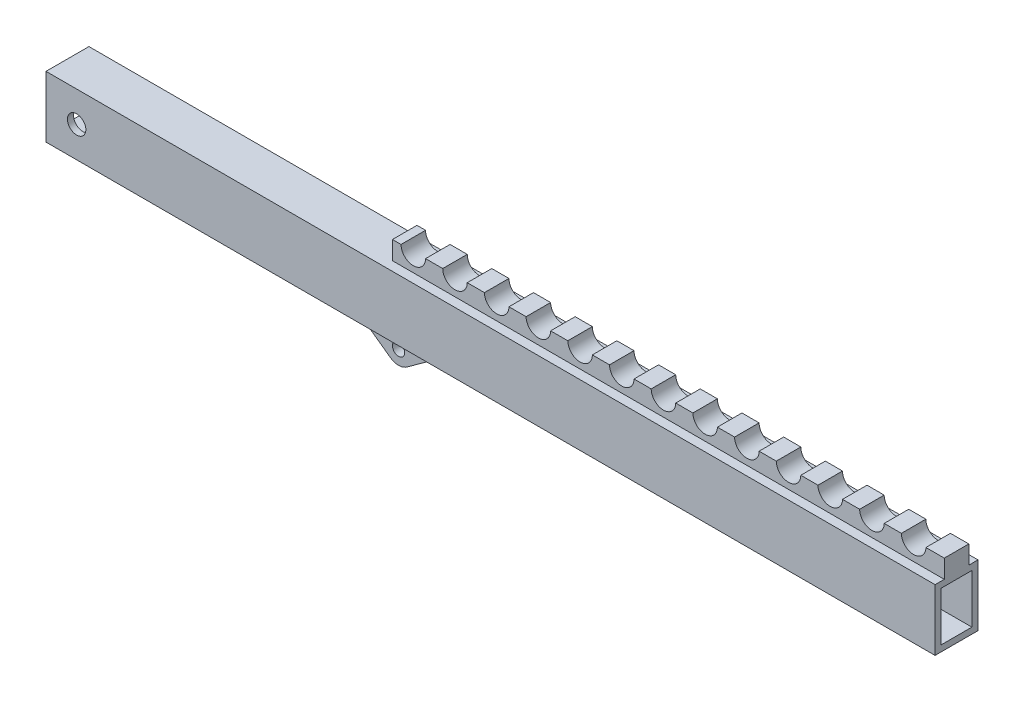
ISO-10303-21;
HEADER;
FILE_DESCRIPTION(('STEP AP214'),'2;1');
FILE_NAME('part.step','',(''),(''),'','','');
FILE_SCHEMA(('AUTOMOTIVE_DESIGN { 1 0 10303 214 1 1 1 1 }'));
ENDSEC;
DATA;
#1=APPLICATION_CONTEXT('core data for automotive mechanical design processes');
#2=APPLICATION_PROTOCOL_DEFINITION('international standard','automotive_design',2000,#1);
#3=PRODUCT_CONTEXT('',#1,'mechanical');
#4=PRODUCT('Part','Part','',(#3));
#5=PRODUCT_RELATED_PRODUCT_CATEGORY('part','',(#4));
#6=PRODUCT_DEFINITION_FORMATION('','',#4);
#7=PRODUCT_DEFINITION_CONTEXT('part definition',#1,'design');
#8=PRODUCT_DEFINITION('design','',#6,#7);
#9=PRODUCT_DEFINITION_SHAPE('','',#8);
#10=(LENGTH_UNIT() NAMED_UNIT(*) SI_UNIT(.MILLI.,.METRE.));
#11=(NAMED_UNIT(*) PLANE_ANGLE_UNIT() SI_UNIT($,.RADIAN.));
#12=(NAMED_UNIT(*) SI_UNIT($,.STERADIAN.) SOLID_ANGLE_UNIT());
#13=UNCERTAINTY_MEASURE_WITH_UNIT(LENGTH_MEASURE(1.E-05),#10,'distance_accuracy_value','');
#14=(GEOMETRIC_REPRESENTATION_CONTEXT(3) GLOBAL_UNCERTAINTY_ASSIGNED_CONTEXT((#13)) GLOBAL_UNIT_ASSIGNED_CONTEXT((#10,
#11,#12)) REPRESENTATION_CONTEXT('',''));
#15=CARTESIAN_POINT('',(0.,0.,0.));
#16=DIRECTION('',(0.,0.,1.));
#17=DIRECTION('',(1.,0.,0.));
#18=AXIS2_PLACEMENT_3D('',#15,#16,#17);
#19=CARTESIAN_POINT('',(-68.8795123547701,-88.3501881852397,35.));
#20=DIRECTION('',(0.,1.,0.));
#21=DIRECTION('',(0.,0.,1.));
#22=AXIS2_PLACEMENT_3D('',#19,#20,#21);
#23=PLANE('',#22);
#24=DIRECTION('',(1.,0.,0.));
#25=VECTOR('',#24,1.);
#26=CARTESIAN_POINT('',(-68.8795123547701,-88.3501881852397,-35.));
#27=LINE('',#26,#25);
#28=CARTESIAN_POINT('',(-68.8795123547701,-88.3501881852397,-35.));
#29=VERTEX_POINT('',#28);
#30=CARTESIAN_POINT('',(1381.12048764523,-88.3501881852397,-35.));
#31=VERTEX_POINT('',#30);
#32=EDGE_CURVE('E393',#29,#31,#27,.T.);
#33=ORIENTED_EDGE('',*,*,#32,.T.);
#34=DIRECTION('',(0.,0.,-1.));
#35=VECTOR('',#34,1.);
#36=CARTESIAN_POINT('',(1381.12048764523,-88.3501881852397,35.));
#37=LINE('',#36,#35);
#38=CARTESIAN_POINT('',(1381.12048764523,-88.3501881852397,35.));
#39=VERTEX_POINT('',#38);
#40=EDGE_CURVE('E35',#39,#31,#37,.T.);
#41=ORIENTED_EDGE('',*,*,#40,.F.);
#42=DIRECTION('',(1.,0.,0.));
#43=VECTOR('',#42,1.);
#44=CARTESIAN_POINT('',(-68.8795123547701,-88.3501881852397,35.));
#45=LINE('',#44,#43);
#46=CARTESIAN_POINT('',(-68.8795123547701,-88.3501881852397,35.));
#47=VERTEX_POINT('',#46);
#48=EDGE_CURVE('E401',#47,#39,#45,.T.);
#49=ORIENTED_EDGE('',*,*,#48,.F.);
#50=DIRECTION('',(0.,0.,-1.));
#51=VECTOR('',#50,1.);
#52=CARTESIAN_POINT('',(-68.8795123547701,-88.3501881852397,35.));
#53=LINE('',#52,#51);
#54=EDGE_CURVE('E11',#47,#29,#53,.T.);
#55=ORIENTED_EDGE('',*,*,#54,.T.);
#56=EDGE_LOOP('',(#33,#41,#49,#55));
#57=FACE_BOUND('',#56,.T.);
#58=DIRECTION('',(0.,0.,-1.));
#59=VECTOR('',#58,1.);
#60=CARTESIAN_POINT('',(400.478063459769,-88.3501881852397,10.));
#61=LINE('',#60,#59);
#62=CARTESIAN_POINT('',(400.478063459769,-88.3501881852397,10.));
#63=VERTEX_POINT('',#62);
#64=CARTESIAN_POINT('',(400.478063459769,-88.3501881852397,-10.));
#65=VERTEX_POINT('',#64);
#66=EDGE_CURVE('E51',#63,#65,#61,.T.);
#67=ORIENTED_EDGE('',*,*,#66,.F.);
#68=DIRECTION('',(-1.,0.,0.));
#69=VECTOR('',#68,1.);
#70=CARTESIAN_POINT('',(400.478063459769,-88.3501881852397,10.));
#71=LINE('',#70,#69);
#72=CARTESIAN_POINT('',(561.762911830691,-88.3501881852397,10.));
#73=VERTEX_POINT('',#72);
#74=EDGE_CURVE('E590',#73,#63,#71,.T.);
#75=ORIENTED_EDGE('',*,*,#74,.F.);
#76=DIRECTION('',(0.,0.,-1.));
#77=VECTOR('',#76,1.);
#78=CARTESIAN_POINT('',(561.762911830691,-88.3501881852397,10.));
#79=LINE('',#78,#77);
#80=CARTESIAN_POINT('',(561.762911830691,-88.3501881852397,-9.99999999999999));
#81=VERTEX_POINT('',#80);
#82=EDGE_CURVE('E593',#73,#81,#79,.T.);
#83=ORIENTED_EDGE('',*,*,#82,.T.);
#84=DIRECTION('',(-1.,0.,0.));
#85=VECTOR('',#84,1.);
#86=CARTESIAN_POINT('',(400.478063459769,-88.3501881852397,-10.));
#87=LINE('',#86,#85);
#88=EDGE_CURVE('E580',#81,#65,#87,.T.);
#89=ORIENTED_EDGE('',*,*,#88,.T.);
#90=EDGE_LOOP('',(#67,#75,#83,#89));
#91=FACE_BOUND('',#90,.T.);
#92=ADVANCED_FACE('F26',(#57,#91),#23,.F.);
#93=CARTESIAN_POINT('',(-68.8795123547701,11.6498118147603,35.));
#94=DIRECTION('',(1.,0.,0.));
#95=DIRECTION('',(0.,1.,0.));
#96=AXIS2_PLACEMENT_3D('',#93,#94,#95);
#97=PLANE('',#96);
#98=DIRECTION('',(0.,-1.,0.));
#99=VECTOR('',#98,1.);
#100=CARTESIAN_POINT('',(-68.8795123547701,11.6498118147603,-35.));
#101=LINE('',#100,#99);
#102=CARTESIAN_POINT('',(-68.8795123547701,11.6498118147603,-35.));
#103=VERTEX_POINT('',#102);
#104=EDGE_CURVE('E384',#103,#29,#101,.T.);
#105=ORIENTED_EDGE('',*,*,#104,.T.);
#106=ORIENTED_EDGE('',*,*,#54,.F.);
#107=DIRECTION('',(0.,-1.,0.));
#108=VECTOR('',#107,1.);
#109=CARTESIAN_POINT('',(-68.8795123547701,11.6498118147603,35.));
#110=LINE('',#109,#108);
#111=CARTESIAN_POINT('',(-68.8795123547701,11.6498118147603,35.));
#112=VERTEX_POINT('',#111);
#113=EDGE_CURVE('E398',#112,#47,#110,.T.);
#114=ORIENTED_EDGE('',*,*,#113,.F.);
#115=DIRECTION('',(0.,0.,-1.));
#116=VECTOR('',#115,1.);
#117=CARTESIAN_POINT('',(-68.8795123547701,11.6498118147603,35.));
#118=LINE('',#117,#116);
#119=EDGE_CURVE('E323',#112,#103,#118,.T.);
#120=ORIENTED_EDGE('',*,*,#119,.T.);
#121=EDGE_LOOP('',(#105,#106,#114,#120));
#122=FACE_BOUND('',#121,.T.);
#123=DIRECTION('',(0.,-1.,0.));
#124=VECTOR('',#123,1.);
#125=CARTESIAN_POINT('',(-68.8795123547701,11.6498118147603,-25.));
#126=LINE('',#125,#124);
#127=CARTESIAN_POINT('',(-68.8795123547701,1.64981181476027,-25.));
#128=VERTEX_POINT('',#127);
#129=CARTESIAN_POINT('',(-68.8795123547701,-78.3501881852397,-25.));
#130=VERTEX_POINT('',#129);
#131=EDGE_CURVE('E346',#128,#130,#126,.T.);
#132=ORIENTED_EDGE('',*,*,#131,.F.);
#133=DIRECTION('',(0.,0.,-1.));
#134=VECTOR('',#133,1.);
#135=CARTESIAN_POINT('',(-68.8795123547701,1.64981181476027,35.));
#136=LINE('',#135,#134);
#137=CARTESIAN_POINT('',(-68.8795123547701,1.64981181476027,25.));
#138=VERTEX_POINT('',#137);
#139=EDGE_CURVE('E369',#138,#128,#136,.T.);
#140=ORIENTED_EDGE('',*,*,#139,.F.);
#141=DIRECTION('',(0.,-1.,0.));
#142=VECTOR('',#141,1.);
#143=CARTESIAN_POINT('',(-68.8795123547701,11.6498118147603,25.));
#144=LINE('',#143,#142);
#145=CARTESIAN_POINT('',(-68.8795123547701,-78.3501881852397,25.));
#146=VERTEX_POINT('',#145);
#147=EDGE_CURVE('E365',#138,#146,#144,.T.);
#148=ORIENTED_EDGE('',*,*,#147,.T.);
#149=DIRECTION('',(0.,0.,-1.));
#150=VECTOR('',#149,1.);
#151=CARTESIAN_POINT('',(-68.8795123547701,-78.3501881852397,35.));
#152=LINE('',#151,#150);
#153=EDGE_CURVE('E375',#146,#130,#152,.T.);
#154=ORIENTED_EDGE('',*,*,#153,.T.);
#155=EDGE_LOOP('',(#132,#140,#148,#154));
#156=FACE_BOUND('',#155,.T.);
#157=ADVANCED_FACE('F28',(#122,#156),#97,.F.);
#158=CARTESIAN_POINT('',(1381.12048764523,11.6498118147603,35.));
#159=DIRECTION('',(-1.,0.,0.));
#160=DIRECTION('',(0.,0.,1.));
#161=AXIS2_PLACEMENT_3D('',#158,#159,#160);
#162=PLANE('',#161);
#163=DIRECTION('',(0.,1.,0.));
#164=VECTOR('',#163,1.);
#165=CARTESIAN_POINT('',(1381.12048764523,11.6498118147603,-35.));
#166=LINE('',#165,#164);
#167=CARTESIAN_POINT('',(1381.12048764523,11.6498118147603,-35.));
#168=VERTEX_POINT('',#167);
#169=EDGE_CURVE('E320',#31,#168,#166,.T.);
#170=ORIENTED_EDGE('',*,*,#169,.T.);
#171=DIRECTION('',(0.,0.,-1.));
#172=VECTOR('',#171,1.);
#173=CARTESIAN_POINT('',(1381.12048764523,11.6498118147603,35.));
#174=LINE('',#173,#172);
#175=CARTESIAN_POINT('',(1381.12048764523,11.6498118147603,-20.));
#176=VERTEX_POINT('',#175);
#177=EDGE_CURVE('E311',#176,#168,#174,.T.);
#178=ORIENTED_EDGE('',*,*,#177,.F.);
#179=DIRECTION('',(0.,1.,0.));
#180=VECTOR('',#179,1.);
#181=CARTESIAN_POINT('',(1381.12048764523,11.6498118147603,-20.));
#182=LINE('',#181,#180);
#183=CARTESIAN_POINT('',(1381.12048764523,41.6498118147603,-20.));
#184=VERTEX_POINT('',#183);
#185=EDGE_CURVE('E298',#176,#184,#182,.T.);
#186=ORIENTED_EDGE('',*,*,#185,.T.);
#187=DIRECTION('',(0.,0.,-1.));
#188=VECTOR('',#187,1.);
#189=CARTESIAN_POINT('',(1381.12048764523,41.6498118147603,20.));
#190=LINE('',#189,#188);
#191=CARTESIAN_POINT('',(1381.12048764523,41.6498118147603,20.));
#192=VERTEX_POINT('',#191);
#193=EDGE_CURVE('E563',#192,#184,#190,.T.);
#194=ORIENTED_EDGE('',*,*,#193,.F.);
#195=DIRECTION('',(0.,1.,0.));
#196=VECTOR('',#195,1.);
#197=CARTESIAN_POINT('',(1381.12048764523,11.6498118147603,20.));
#198=LINE('',#197,#196);
#199=CARTESIAN_POINT('',(1381.12048764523,11.6498118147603,20.));
#200=VERTEX_POINT('',#199);
#201=EDGE_CURVE('E418',#200,#192,#198,.T.);
#202=ORIENTED_EDGE('',*,*,#201,.F.);
#203=CARTESIAN_POINT('',(1381.12048764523,11.6498118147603,35.));
#204=VERTEX_POINT('',#203);
#205=EDGE_CURVE('E322',#204,#200,#174,.T.);
#206=ORIENTED_EDGE('',*,*,#205,.F.);
#207=DIRECTION('',(0.,1.,0.));
#208=VECTOR('',#207,1.);
#209=CARTESIAN_POINT('',(1381.12048764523,11.6498118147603,35.));
#210=LINE('',#209,#208);
#211=EDGE_CURVE('E403',#39,#204,#210,.T.);
#212=ORIENTED_EDGE('',*,*,#211,.F.);
#213=ORIENTED_EDGE('',*,*,#40,.T.);
#214=EDGE_LOOP('',(#170,#178,#186,#194,#202,#206,#212,#213));
#215=FACE_BOUND('',#214,.T.);
#216=DIRECTION('',(0.,1.,0.));
#217=VECTOR('',#216,1.);
#218=CARTESIAN_POINT('',(1381.12048764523,11.6498118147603,-25.));
#219=LINE('',#218,#217);
#220=CARTESIAN_POINT('',(1381.12048764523,-78.3501881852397,-25.));
#221=VERTEX_POINT('',#220);
#222=CARTESIAN_POINT('',(1381.12048764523,1.64981181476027,-25.));
#223=VERTEX_POINT('',#222);
#224=EDGE_CURVE('E360',#221,#223,#219,.T.);
#225=ORIENTED_EDGE('',*,*,#224,.F.);
#226=DIRECTION('',(0.,0.,-1.));
#227=VECTOR('',#226,1.);
#228=CARTESIAN_POINT('',(1381.12048764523,-78.3501881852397,35.));
#229=LINE('',#228,#227);
#230=CARTESIAN_POINT('',(1381.12048764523,-78.3501881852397,25.));
#231=VERTEX_POINT('',#230);
#232=EDGE_CURVE('E372',#231,#221,#229,.T.);
#233=ORIENTED_EDGE('',*,*,#232,.F.);
#234=DIRECTION('',(0.,1.,0.));
#235=VECTOR('',#234,1.);
#236=CARTESIAN_POINT('',(1381.12048764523,11.6498118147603,25.));
#237=LINE('',#236,#235);
#238=CARTESIAN_POINT('',(1381.12048764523,1.64981181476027,25.));
#239=VERTEX_POINT('',#238);
#240=EDGE_CURVE('E364',#231,#239,#237,.T.);
#241=ORIENTED_EDGE('',*,*,#240,.T.);
#242=DIRECTION('',(0.,0.,-1.));
#243=VECTOR('',#242,1.);
#244=CARTESIAN_POINT('',(1381.12048764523,1.64981181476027,35.));
#245=LINE('',#244,#243);
#246=EDGE_CURVE('E376',#239,#223,#245,.T.);
#247=ORIENTED_EDGE('',*,*,#246,.T.);
#248=EDGE_LOOP('',(#225,#233,#241,#247));
#249=FACE_BOUND('',#248,.T.);
#250=ADVANCED_FACE('F316',(#215,#249),#162,.F.);
#251=CARTESIAN_POINT('',(-68.8795123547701,11.6498118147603,35.));
#252=DIRECTION('',(0.,-1.,0.));
#253=DIRECTION('',(0.,0.,-1.));
#254=AXIS2_PLACEMENT_3D('',#251,#252,#253);
#255=PLANE('',#254);
#256=DIRECTION('',(0.,0.,-1.));
#257=VECTOR('',#256,1.);
#258=CARTESIAN_POINT('',(481.12048764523,11.6498118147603,20.));
#259=LINE('',#258,#257);
#260=CARTESIAN_POINT('',(481.12048764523,11.6498118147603,20.));
#261=VERTEX_POINT('',#260);
#262=CARTESIAN_POINT('',(481.12048764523,11.6498118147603,-20.));
#263=VERTEX_POINT('',#262);
#264=EDGE_CURVE('E314',#261,#263,#259,.T.);
#265=ORIENTED_EDGE('',*,*,#264,.T.);
#266=DIRECTION('',(1.,0.,0.));
#267=VECTOR('',#266,1.);
#268=CARTESIAN_POINT('',(481.12048764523,11.6498118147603,-20.));
#269=LINE('',#268,#267);
#270=EDGE_CURVE('E301',#263,#176,#269,.T.);
#271=ORIENTED_EDGE('',*,*,#270,.T.);
#272=ORIENTED_EDGE('',*,*,#177,.T.);
#273=DIRECTION('',(-1.,0.,0.));
#274=VECTOR('',#273,1.);
#275=CARTESIAN_POINT('',(-68.8795123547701,11.6498118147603,-35.));
#276=LINE('',#275,#274);
#277=EDGE_CURVE('E396',#168,#103,#276,.T.);
#278=ORIENTED_EDGE('',*,*,#277,.T.);
#279=ORIENTED_EDGE('',*,*,#119,.F.);
#280=DIRECTION('',(-1.,0.,0.));
#281=VECTOR('',#280,1.);
#282=CARTESIAN_POINT('',(-68.8795123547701,11.6498118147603,35.));
#283=LINE('',#282,#281);
#284=EDGE_CURVE('E328',#204,#112,#283,.T.);
#285=ORIENTED_EDGE('',*,*,#284,.F.);
#286=ORIENTED_EDGE('',*,*,#205,.T.);
#287=DIRECTION('',(1.,0.,0.));
#288=VECTOR('',#287,1.);
#289=CARTESIAN_POINT('',(481.12048764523,11.6498118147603,20.));
#290=LINE('',#289,#288);
#291=EDGE_CURVE('E333',#261,#200,#290,.T.);
#292=ORIENTED_EDGE('',*,*,#291,.F.);
#293=EDGE_LOOP('',(#265,#271,#272,#278,#279,#285,#286,#292));
#294=FACE_BOUND('',#293,.T.);
#295=ADVANCED_FACE('F310',(#294),#255,.F.);
#296=CARTESIAN_POINT('',(-68.8795123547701,-88.3501881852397,35.));
#297=DIRECTION('',(0.,0.,1.));
#298=DIRECTION('',(1.,0.,0.));
#299=AXIS2_PLACEMENT_3D('',#296,#297,#298);
#300=PLANE('',#299);
#301=CARTESIAN_POINT('',(-18.8795123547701,-38.3501881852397,35.));
#302=DIRECTION('',(0.,0.,1.));
#303=DIRECTION('',(1.,0.,0.));
#304=AXIS2_PLACEMENT_3D('',#301,#302,#303);
#305=CIRCLE('',#304,15.);
#306=CARTESIAN_POINT('',(-3.87951235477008,-38.3501881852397,35.));
#307=VERTEX_POINT('',#306);
#308=EDGE_CURVE('E349',#307,#307,#305,.T.);
#309=ORIENTED_EDGE('',*,*,#308,.F.);
#310=EDGE_LOOP('',(#309));
#311=FACE_BOUND('',#310,.T.);
#312=ORIENTED_EDGE('',*,*,#113,.T.);
#313=ORIENTED_EDGE('',*,*,#48,.T.);
#314=ORIENTED_EDGE('',*,*,#211,.T.);
#315=ORIENTED_EDGE('',*,*,#284,.T.);
#316=EDGE_LOOP('',(#312,#313,#314,#315));
#317=FACE_BOUND('',#316,.T.);
#318=ADVANCED_FACE('F407',(#311,#317),#300,.T.);
#319=CARTESIAN_POINT('',(-68.8795123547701,-88.3501881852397,-35.));
#320=DIRECTION('',(0.,0.,1.));
#321=DIRECTION('',(1.,0.,0.));
#322=AXIS2_PLACEMENT_3D('',#319,#320,#321);
#323=PLANE('',#322);
#324=CARTESIAN_POINT('',(-18.8795123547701,-38.3501881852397,-35.));
#325=DIRECTION('',(0.,0.,1.));
#326=DIRECTION('',(1.,0.,0.));
#327=AXIS2_PLACEMENT_3D('',#324,#325,#326);
#328=CIRCLE('',#327,15.);
#329=CARTESIAN_POINT('',(-3.87951235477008,-38.3501881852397,-35.));
#330=VERTEX_POINT('',#329);
#331=EDGE_CURVE('E342',#330,#330,#328,.T.);
#332=ORIENTED_EDGE('',*,*,#331,.T.);
#333=EDGE_LOOP('',(#332));
#334=FACE_BOUND('',#333,.T.);
#335=ORIENTED_EDGE('',*,*,#104,.F.);
#336=ORIENTED_EDGE('',*,*,#277,.F.);
#337=ORIENTED_EDGE('',*,*,#169,.F.);
#338=ORIENTED_EDGE('',*,*,#32,.F.);
#339=EDGE_LOOP('',(#335,#336,#337,#338));
#340=FACE_BOUND('',#339,.T.);
#341=ADVANCED_FACE('F631',(#334,#340),#323,.F.);
#342=CARTESIAN_POINT('',(-68.8795123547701,-78.3501881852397,35.));
#343=DIRECTION('',(0.,1.,0.));
#344=DIRECTION('',(0.,0.,1.));
#345=AXIS2_PLACEMENT_3D('',#342,#343,#344);
#346=PLANE('',#345);
#347=DIRECTION('',(1.,0.,0.));
#348=VECTOR('',#347,1.);
#349=CARTESIAN_POINT('',(-68.8795123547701,-78.3501881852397,-25.));
#350=LINE('',#349,#348);
#351=EDGE_CURVE('E358',#130,#221,#350,.T.);
#352=ORIENTED_EDGE('',*,*,#351,.F.);
#353=ORIENTED_EDGE('',*,*,#153,.F.);
#354=DIRECTION('',(1.,0.,0.));
#355=VECTOR('',#354,1.);
#356=CARTESIAN_POINT('',(-68.8795123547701,-78.3501881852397,25.));
#357=LINE('',#356,#355);
#358=EDGE_CURVE('E361',#146,#231,#357,.T.);
#359=ORIENTED_EDGE('',*,*,#358,.T.);
#360=ORIENTED_EDGE('',*,*,#232,.T.);
#361=EDGE_LOOP('',(#352,#353,#359,#360));
#362=FACE_BOUND('',#361,.T.);
#363=ADVANCED_FACE('F635',(#362),#346,.T.);
#364=CARTESIAN_POINT('',(-68.8795123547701,1.64981181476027,35.));
#365=DIRECTION('',(0.,-1.,0.));
#366=DIRECTION('',(0.,0.,-1.));
#367=AXIS2_PLACEMENT_3D('',#364,#365,#366);
#368=PLANE('',#367);
#369=DIRECTION('',(-1.,0.,0.));
#370=VECTOR('',#369,1.);
#371=CARTESIAN_POINT('',(-68.8795123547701,1.64981181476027,-25.));
#372=LINE('',#371,#370);
#373=EDGE_CURVE('E370',#223,#128,#372,.T.);
#374=ORIENTED_EDGE('',*,*,#373,.F.);
#375=ORIENTED_EDGE('',*,*,#246,.F.);
#376=DIRECTION('',(-1.,0.,0.));
#377=VECTOR('',#376,1.);
#378=CARTESIAN_POINT('',(-68.8795123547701,1.64981181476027,25.));
#379=LINE('',#378,#377);
#380=EDGE_CURVE('E366',#239,#138,#379,.T.);
#381=ORIENTED_EDGE('',*,*,#380,.T.);
#382=ORIENTED_EDGE('',*,*,#139,.T.);
#383=EDGE_LOOP('',(#374,#375,#381,#382));
#384=FACE_BOUND('',#383,.T.);
#385=ADVANCED_FACE('F644',(#384),#368,.T.);
#386=CARTESIAN_POINT('',(-68.8795123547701,-88.3501881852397,25.));
#387=DIRECTION('',(0.,0.,1.));
#388=DIRECTION('',(1.,0.,0.));
#389=AXIS2_PLACEMENT_3D('',#386,#387,#388);
#390=PLANE('',#389);
#391=CARTESIAN_POINT('',(-18.8795123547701,-38.3501881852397,25.));
#392=DIRECTION('',(0.,0.,1.));
#393=DIRECTION('',(1.,0.,0.));
#394=AXIS2_PLACEMENT_3D('',#391,#392,#393);
#395=CIRCLE('',#394,15.);
#396=CARTESIAN_POINT('',(-3.87951235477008,-38.3501881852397,25.));
#397=VERTEX_POINT('',#396);
#398=EDGE_CURVE('E341',#397,#397,#395,.T.);
#399=ORIENTED_EDGE('',*,*,#398,.T.);
#400=EDGE_LOOP('',(#399));
#401=FACE_BOUND('',#400,.T.);
#402=ORIENTED_EDGE('',*,*,#147,.F.);
#403=ORIENTED_EDGE('',*,*,#380,.F.);
#404=ORIENTED_EDGE('',*,*,#240,.F.);
#405=ORIENTED_EDGE('',*,*,#358,.F.);
#406=EDGE_LOOP('',(#402,#403,#404,#405));
#407=FACE_BOUND('',#406,.T.);
#408=ADVANCED_FACE('F640',(#401,#407),#390,.F.);
#409=CARTESIAN_POINT('',(-68.8795123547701,-88.3501881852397,-25.));
#410=DIRECTION('',(0.,0.,1.));
#411=DIRECTION('',(1.,0.,0.));
#412=AXIS2_PLACEMENT_3D('',#409,#410,#411);
#413=PLANE('',#412);
#414=CARTESIAN_POINT('',(-18.8795123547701,-38.3501881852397,-25.));
#415=DIRECTION('',(0.,0.,1.));
#416=DIRECTION('',(1.,0.,0.));
#417=AXIS2_PLACEMENT_3D('',#414,#415,#416);
#418=CIRCLE('',#417,15.);
#419=CARTESIAN_POINT('',(-3.87951235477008,-38.3501881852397,-25.));
#420=VERTEX_POINT('',#419);
#421=EDGE_CURVE('E339',#420,#420,#418,.T.);
#422=ORIENTED_EDGE('',*,*,#421,.F.);
#423=EDGE_LOOP('',(#422));
#424=FACE_BOUND('',#423,.T.);
#425=ORIENTED_EDGE('',*,*,#131,.T.);
#426=ORIENTED_EDGE('',*,*,#351,.T.);
#427=ORIENTED_EDGE('',*,*,#224,.T.);
#428=ORIENTED_EDGE('',*,*,#373,.T.);
#429=EDGE_LOOP('',(#425,#426,#427,#428));
#430=FACE_BOUND('',#429,.T.);
#431=ADVANCED_FACE('F636',(#424,#430),#413,.T.);
#432=CARTESIAN_POINT('',(-18.8795123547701,-38.3501881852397,-35.));
#433=DIRECTION('',(0.,0.,1.));
#434=DIRECTION('',(1.,0.,0.));
#435=AXIS2_PLACEMENT_3D('',#432,#433,#434);
#436=CYLINDRICAL_SURFACE('',#435,15.);
#437=ORIENTED_EDGE('',*,*,#421,.T.);
#438=EDGE_LOOP('',(#437));
#439=FACE_BOUND('',#438,.T.);
#440=ORIENTED_EDGE('',*,*,#331,.F.);
#441=EDGE_LOOP('',(#440));
#442=FACE_BOUND('',#441,.T.);
#443=ADVANCED_FACE('F639',(#439,#442),#436,.F.);
#444=ORIENTED_EDGE('',*,*,#308,.T.);
#445=EDGE_LOOP('',(#444));
#446=FACE_BOUND('',#445,.T.);
#447=ORIENTED_EDGE('',*,*,#398,.F.);
#448=EDGE_LOOP('',(#447));
#449=FACE_BOUND('',#448,.T.);
#450=ADVANCED_FACE('F654',(#446,#449),#436,.F.);
#451=CARTESIAN_POINT('',(481.12048764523,-118.35018818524,10.));
#452=DIRECTION('',(0.,0.,1.));
#453=DIRECTION('',(1.,0.,0.));
#454=AXIS2_PLACEMENT_3D('',#451,#452,#453);
#455=PLANE('',#454);
#456=DIRECTION('',(0.811414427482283,-0.584471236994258,0.));
#457=VECTOR('',#456,1.);
#458=CARTESIAN_POINT('',(400.478063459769,-88.3501881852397,10.));
#459=LINE('',#458,#457);
#460=CARTESIAN_POINT('',(467.799952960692,-136.842927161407,10.));
#461=VERTEX_POINT('',#460);
#462=EDGE_CURVE('E582',#63,#461,#459,.T.);
#463=ORIENTED_EDGE('',*,*,#462,.T.);
#464=CARTESIAN_POINT('',(481.12048764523,-118.35018818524,10.));
#465=DIRECTION('',(0.,0.,1.));
#466=DIRECTION('',(1.,0.,0.));
#467=AXIS2_PLACEMENT_3D('',#464,#465,#466);
#468=CIRCLE('',#467,22.7907445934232);
#469=CARTESIAN_POINT('',(494.441022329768,-136.842927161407,10.));
#470=VERTEX_POINT('',#469);
#471=EDGE_CURVE('E585',#461,#470,#468,.T.);
#472=ORIENTED_EDGE('',*,*,#471,.T.);
#473=DIRECTION('',(0.811414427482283,0.584471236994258,0.));
#474=VECTOR('',#473,1.);
#475=CARTESIAN_POINT('',(561.762911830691,-88.3501881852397,10.));
#476=LINE('',#475,#474);
#477=EDGE_CURVE('E587',#470,#73,#476,.T.);
#478=ORIENTED_EDGE('',*,*,#477,.T.);
#479=ORIENTED_EDGE('',*,*,#74,.T.);
#480=EDGE_LOOP('',(#463,#472,#478,#479));
#481=FACE_BOUND('',#480,.T.);
#482=CARTESIAN_POINT('',(481.12048764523,-118.35018818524,10.));
#483=DIRECTION('',(0.,0.,1.));
#484=DIRECTION('',(1.,0.,0.));
#485=AXIS2_PLACEMENT_3D('',#482,#483,#484);
#486=CIRCLE('',#485,9.99999999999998);
#487=CARTESIAN_POINT('',(491.12048764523,-118.35018818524,10.));
#488=VERTEX_POINT('',#487);
#489=EDGE_CURVE('E569',#488,#488,#486,.T.);
#490=ORIENTED_EDGE('',*,*,#489,.F.);
#491=EDGE_LOOP('',(#490));
#492=FACE_BOUND('',#491,.T.);
#493=ADVANCED_FACE('F616',(#481,#492),#455,.T.);
#494=CARTESIAN_POINT('',(481.12048764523,-118.35018818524,-10.));
#495=DIRECTION('',(0.,0.,1.));
#496=DIRECTION('',(1.,0.,0.));
#497=AXIS2_PLACEMENT_3D('',#494,#495,#496);
#498=PLANE('',#497);
#499=DIRECTION('',(0.811414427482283,-0.584471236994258,0.));
#500=VECTOR('',#499,1.);
#501=CARTESIAN_POINT('',(400.478063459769,-88.3501881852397,-10.));
#502=LINE('',#501,#500);
#503=CARTESIAN_POINT('',(467.799952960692,-136.842927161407,-10.));
#504=VERTEX_POINT('',#503);
#505=EDGE_CURVE('E572',#65,#504,#502,.T.);
#506=ORIENTED_EDGE('',*,*,#505,.F.);
#507=ORIENTED_EDGE('',*,*,#88,.F.);
#508=DIRECTION('',(0.811414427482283,0.584471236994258,0.));
#509=VECTOR('',#508,1.);
#510=CARTESIAN_POINT('',(561.762911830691,-88.3501881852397,-10.));
#511=LINE('',#510,#509);
#512=CARTESIAN_POINT('',(494.441022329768,-136.842927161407,-10.));
#513=VERTEX_POINT('',#512);
#514=EDGE_CURVE('E577',#513,#81,#511,.T.);
#515=ORIENTED_EDGE('',*,*,#514,.F.);
#516=CARTESIAN_POINT('',(481.12048764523,-118.35018818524,-10.));
#517=DIRECTION('',(0.,0.,1.));
#518=DIRECTION('',(1.,0.,0.));
#519=AXIS2_PLACEMENT_3D('',#516,#517,#518);
#520=CIRCLE('',#519,22.7907445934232);
#521=EDGE_CURVE('E575',#504,#513,#520,.T.);
#522=ORIENTED_EDGE('',*,*,#521,.F.);
#523=EDGE_LOOP('',(#506,#507,#515,#522));
#524=FACE_BOUND('',#523,.T.);
#525=CARTESIAN_POINT('',(481.12048764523,-118.35018818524,-10.));
#526=DIRECTION('',(0.,0.,1.));
#527=DIRECTION('',(1.,0.,0.));
#528=AXIS2_PLACEMENT_3D('',#525,#526,#527);
#529=CIRCLE('',#528,9.99999999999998);
#530=CARTESIAN_POINT('',(491.12048764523,-118.35018818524,-10.));
#531=VERTEX_POINT('',#530);
#532=EDGE_CURVE('E566',#531,#531,#529,.T.);
#533=ORIENTED_EDGE('',*,*,#532,.T.);
#534=EDGE_LOOP('',(#533));
#535=FACE_BOUND('',#534,.T.);
#536=ADVANCED_FACE('F608',(#524,#535),#498,.F.);
#537=CARTESIAN_POINT('',(400.478063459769,-88.3501881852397,10.));
#538=DIRECTION('',(0.584471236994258,0.811414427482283,0.));
#539=DIRECTION('',(-0.811414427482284,0.584471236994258,0.));
#540=AXIS2_PLACEMENT_3D('',#537,#538,#539);
#541=PLANE('',#540);
#542=ORIENTED_EDGE('',*,*,#505,.T.);
#543=DIRECTION('',(0.,0.,-1.));
#544=VECTOR('',#543,1.);
#545=CARTESIAN_POINT('',(467.799952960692,-136.842927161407,10.));
#546=LINE('',#545,#544);
#547=EDGE_CURVE('E354',#461,#504,#546,.T.);
#548=ORIENTED_EDGE('',*,*,#547,.F.);
#549=ORIENTED_EDGE('',*,*,#462,.F.);
#550=ORIENTED_EDGE('',*,*,#66,.T.);
#551=EDGE_LOOP('',(#542,#548,#549,#550));
#552=FACE_BOUND('',#551,.T.);
#553=ADVANCED_FACE('F605',(#552),#541,.F.);
#554=CARTESIAN_POINT('',(481.12048764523,-118.35018818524,10.));
#555=DIRECTION('',(0.,0.,-1.));
#556=DIRECTION('',(-1.,0.,0.));
#557=AXIS2_PLACEMENT_3D('',#554,#555,#556);
#558=CYLINDRICAL_SURFACE('',#557,22.7907445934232);
#559=ORIENTED_EDGE('',*,*,#521,.T.);
#560=DIRECTION('',(0.,0.,-1.));
#561=VECTOR('',#560,1.);
#562=CARTESIAN_POINT('',(494.441022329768,-136.842927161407,10.));
#563=LINE('',#562,#561);
#564=EDGE_CURVE('E595',#470,#513,#563,.T.);
#565=ORIENTED_EDGE('',*,*,#564,.F.);
#566=ORIENTED_EDGE('',*,*,#471,.F.);
#567=ORIENTED_EDGE('',*,*,#547,.T.);
#568=EDGE_LOOP('',(#559,#565,#566,#567));
#569=FACE_BOUND('',#568,.T.);
#570=ADVANCED_FACE('F600',(#569),#558,.T.);
#571=CARTESIAN_POINT('',(561.762911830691,-88.3501881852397,10.));
#572=DIRECTION('',(-0.584471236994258,0.811414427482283,0.));
#573=DIRECTION('',(-0.811414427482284,-0.584471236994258,0.));
#574=AXIS2_PLACEMENT_3D('',#571,#572,#573);
#575=PLANE('',#574);
#576=ORIENTED_EDGE('',*,*,#514,.T.);
#577=ORIENTED_EDGE('',*,*,#82,.F.);
#578=ORIENTED_EDGE('',*,*,#477,.F.);
#579=ORIENTED_EDGE('',*,*,#564,.T.);
#580=EDGE_LOOP('',(#576,#577,#578,#579));
#581=FACE_BOUND('',#580,.T.);
#582=ADVANCED_FACE('F613',(#581),#575,.F.);
#583=CARTESIAN_POINT('',(481.12048764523,-118.35018818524,10.));
#584=DIRECTION('',(0.,0.,-1.));
#585=DIRECTION('',(-1.,0.,0.));
#586=AXIS2_PLACEMENT_3D('',#583,#584,#585);
#587=CYLINDRICAL_SURFACE('',#586,9.99999999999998);
#588=ORIENTED_EDGE('',*,*,#489,.T.);
#589=EDGE_LOOP('',(#588));
#590=FACE_BOUND('',#589,.T.);
#591=ORIENTED_EDGE('',*,*,#532,.F.);
#592=EDGE_LOOP('',(#591));
#593=FACE_BOUND('',#592,.T.);
#594=ADVANCED_FACE('F661',(#590,#593),#587,.F.);
#595=CARTESIAN_POINT('',(481.12048764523,11.6498118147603,20.));
#596=DIRECTION('',(1.,0.,0.));
#597=DIRECTION('',(0.,0.,-1.));
#598=AXIS2_PLACEMENT_3D('',#595,#596,#597);
#599=PLANE('',#598);
#600=DIRECTION('',(0.,-1.,0.));
#601=VECTOR('',#600,1.);
#602=CARTESIAN_POINT('',(481.12048764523,11.6498118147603,-20.));
#603=LINE('',#602,#601);
#604=CARTESIAN_POINT('',(481.12048764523,41.6498118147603,-20.));
#605=VERTEX_POINT('',#604);
#606=EDGE_CURVE('E43',#605,#263,#603,.T.);
#607=ORIENTED_EDGE('',*,*,#606,.T.);
#608=ORIENTED_EDGE('',*,*,#264,.F.);
#609=DIRECTION('',(0.,-1.,0.));
#610=VECTOR('',#609,1.);
#611=CARTESIAN_POINT('',(481.12048764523,11.6498118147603,20.));
#612=LINE('',#611,#610);
#613=CARTESIAN_POINT('',(481.12048764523,41.6498118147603,20.));
#614=VERTEX_POINT('',#613);
#615=EDGE_CURVE('E420',#614,#261,#612,.T.);
#616=ORIENTED_EDGE('',*,*,#615,.F.);
#617=DIRECTION('',(0.,0.,-1.));
#618=VECTOR('',#617,1.);
#619=CARTESIAN_POINT('',(481.12048764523,41.6498118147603,20.));
#620=LINE('',#619,#618);
#621=EDGE_CURVE('E483',#614,#605,#620,.T.);
#622=ORIENTED_EDGE('',*,*,#621,.T.);
#623=EDGE_LOOP('',(#607,#608,#616,#622));
#624=FACE_BOUND('',#623,.T.);
#625=ADVANCED_FACE('F667',(#624),#599,.F.);
#626=CARTESIAN_POINT('',(1351.12048764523,41.6498118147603,20.));
#627=DIRECTION('',(0.,-1.,0.));
#628=DIRECTION('',(0.,0.,-1.));
#629=AXIS2_PLACEMENT_3D('',#626,#627,#628);
#630=PLANE('',#629);
#631=DIRECTION('',(-1.,0.,0.));
#632=VECTOR('',#631,1.);
#633=CARTESIAN_POINT('',(1351.12048764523,41.6498118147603,-20.));
#634=LINE('',#633,#632);
#635=CARTESIAN_POINT('',(1351.12048764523,41.6498118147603,-20.));
#636=VERTEX_POINT('',#635);
#637=EDGE_CURVE('E304',#184,#636,#634,.T.);
#638=ORIENTED_EDGE('',*,*,#637,.T.);
#639=DIRECTION('',(0.,0.,-1.));
#640=VECTOR('',#639,1.);
#641=CARTESIAN_POINT('',(1351.12048764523,41.6498118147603,20.));
#642=LINE('',#641,#640);
#643=CARTESIAN_POINT('',(1351.12048764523,41.6498118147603,20.));
#644=VERTEX_POINT('',#643);
#645=EDGE_CURVE('E560',#644,#636,#642,.T.);
#646=ORIENTED_EDGE('',*,*,#645,.F.);
#647=DIRECTION('',(-1.,0.,0.));
#648=VECTOR('',#647,1.);
#649=CARTESIAN_POINT('',(1351.12048764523,41.6498118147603,20.));
#650=LINE('',#649,#648);
#651=EDGE_CURVE('E421',#192,#644,#650,.T.);
#652=ORIENTED_EDGE('',*,*,#651,.F.);
#653=ORIENTED_EDGE('',*,*,#193,.T.);
#654=EDGE_LOOP('',(#638,#646,#652,#653));
#655=FACE_BOUND('',#654,.T.);
#656=ADVANCED_FACE('F671',(#655),#630,.F.);
#657=CARTESIAN_POINT('',(1331.12048764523,41.6498118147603,20.));
#658=DIRECTION('',(0.,0.,-1.));
#659=DIRECTION('',(-1.,0.,0.));
#660=AXIS2_PLACEMENT_3D('',#657,#658,#659);
#661=CYLINDRICAL_SURFACE('',#660,20.);
#662=CARTESIAN_POINT('',(1331.12048764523,41.6498118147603,-20.));
#663=DIRECTION('',(0.,0.,-1.));
#664=DIRECTION('',(1.,0.,0.));
#665=AXIS2_PLACEMENT_3D('',#662,#663,#664);
#666=CIRCLE('',#665,20.);
#667=CARTESIAN_POINT('',(1311.12048764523,41.6498118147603,-20.));
#668=VERTEX_POINT('',#667);
#669=EDGE_CURVE('E1002',#636,#668,#666,.T.);
#670=ORIENTED_EDGE('',*,*,#669,.T.);
#671=DIRECTION('',(0.,0.,-1.));
#672=VECTOR('',#671,1.);
#673=CARTESIAN_POINT('',(1311.12048764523,41.6498118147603,20.));
#674=LINE('',#673,#672);
#675=CARTESIAN_POINT('',(1311.12048764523,41.6498118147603,20.));
#676=VERTEX_POINT('',#675);
#677=EDGE_CURVE('E557',#676,#668,#674,.T.);
#678=ORIENTED_EDGE('',*,*,#677,.F.);
#679=CARTESIAN_POINT('',(1331.12048764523,41.6498118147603,20.));
#680=DIRECTION('',(0.,0.,-1.));
#681=DIRECTION('',(1.,0.,0.));
#682=AXIS2_PLACEMENT_3D('',#679,#680,#681);
#683=CIRCLE('',#682,20.);
#684=EDGE_CURVE('E431',#644,#676,#683,.T.);
#685=ORIENTED_EDGE('',*,*,#684,.F.);
#686=ORIENTED_EDGE('',*,*,#645,.T.);
#687=EDGE_LOOP('',(#670,#678,#685,#686));
#688=FACE_BOUND('',#687,.T.);
#689=ADVANCED_FACE('F674',(#688),#661,.F.);
#690=CARTESIAN_POINT('',(1283.12048764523,41.6498118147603,20.));
#691=DIRECTION('',(0.,-1.,0.));
#692=DIRECTION('',(0.,0.,-1.));
#693=AXIS2_PLACEMENT_3D('',#690,#691,#692);
#694=PLANE('',#693);
#695=DIRECTION('',(-1.,0.,0.));
#696=VECTOR('',#695,1.);
#697=CARTESIAN_POINT('',(1283.12048764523,41.6498118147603,-20.));
#698=LINE('',#697,#696);
#699=CARTESIAN_POINT('',(1283.12048764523,41.6498118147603,-20.));
#700=VERTEX_POINT('',#699);
#701=EDGE_CURVE('E1004',#668,#700,#698,.T.);
#702=ORIENTED_EDGE('',*,*,#701,.T.);
#703=DIRECTION('',(0.,0.,-1.));
#704=VECTOR('',#703,1.);
#705=CARTESIAN_POINT('',(1283.12048764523,41.6498118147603,20.));
#706=LINE('',#705,#704);
#707=CARTESIAN_POINT('',(1283.12048764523,41.6498118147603,20.));
#708=VERTEX_POINT('',#707);
#709=EDGE_CURVE('E554',#708,#700,#706,.T.);
#710=ORIENTED_EDGE('',*,*,#709,.F.);
#711=DIRECTION('',(-1.,0.,0.));
#712=VECTOR('',#711,1.);
#713=CARTESIAN_POINT('',(1283.12048764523,41.6498118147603,20.));
#714=LINE('',#713,#712);
#715=EDGE_CURVE('E433',#676,#708,#714,.T.);
#716=ORIENTED_EDGE('',*,*,#715,.F.);
#717=ORIENTED_EDGE('',*,*,#677,.T.);
#718=EDGE_LOOP('',(#702,#710,#716,#717));
#719=FACE_BOUND('',#718,.T.);
#720=ADVANCED_FACE('F678',(#719),#694,.F.);
#721=CARTESIAN_POINT('',(1263.12048764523,41.6498118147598,20.));
#722=DIRECTION('',(0.,0.,-1.));
#723=DIRECTION('',(-1.,0.,0.));
#724=AXIS2_PLACEMENT_3D('',#721,#722,#723);
#725=CYLINDRICAL_SURFACE('',#724,20.);
#726=CARTESIAN_POINT('',(1263.12048764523,41.6498118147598,-20.));
#727=DIRECTION('',(0.,0.,-1.));
#728=DIRECTION('',(1.,0.,0.));
#729=AXIS2_PLACEMENT_3D('',#726,#727,#728);
#730=CIRCLE('',#729,20.);
#731=CARTESIAN_POINT('',(1243.12048764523,41.6498118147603,-20.));
#732=VERTEX_POINT('',#731);
#733=EDGE_CURVE('E1006',#700,#732,#730,.T.);
#734=ORIENTED_EDGE('',*,*,#733,.T.);
#735=DIRECTION('',(0.,0.,-1.));
#736=VECTOR('',#735,1.);
#737=CARTESIAN_POINT('',(1243.12048764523,41.6498118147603,20.));
#738=LINE('',#737,#736);
#739=CARTESIAN_POINT('',(1243.12048764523,41.6498118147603,20.));
#740=VERTEX_POINT('',#739);
#741=EDGE_CURVE('E551',#740,#732,#738,.T.);
#742=ORIENTED_EDGE('',*,*,#741,.F.);
#743=CARTESIAN_POINT('',(1263.12048764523,41.6498118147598,20.));
#744=DIRECTION('',(0.,0.,-1.));
#745=DIRECTION('',(1.,0.,0.));
#746=AXIS2_PLACEMENT_3D('',#743,#744,#745);
#747=CIRCLE('',#746,20.);
#748=EDGE_CURVE('E435',#708,#740,#747,.T.);
#749=ORIENTED_EDGE('',*,*,#748,.F.);
#750=ORIENTED_EDGE('',*,*,#709,.T.);
#751=EDGE_LOOP('',(#734,#742,#749,#750));
#752=FACE_BOUND('',#751,.T.);
#753=ADVANCED_FACE('F682',(#752),#725,.F.);
#754=CARTESIAN_POINT('',(1215.12048764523,41.6498118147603,20.));
#755=DIRECTION('',(0.,-1.,0.));
#756=DIRECTION('',(0.,0.,-1.));
#757=AXIS2_PLACEMENT_3D('',#754,#755,#756);
#758=PLANE('',#757);
#759=DIRECTION('',(-1.,0.,0.));
#760=VECTOR('',#759,1.);
#761=CARTESIAN_POINT('',(1215.12048764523,41.6498118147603,-20.));
#762=LINE('',#761,#760);
#763=CARTESIAN_POINT('',(1215.12048764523,41.6498118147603,-20.));
#764=VERTEX_POINT('',#763);
#765=EDGE_CURVE('E1008',#732,#764,#762,.T.);
#766=ORIENTED_EDGE('',*,*,#765,.T.);
#767=DIRECTION('',(0.,0.,-1.));
#768=VECTOR('',#767,1.);
#769=CARTESIAN_POINT('',(1215.12048764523,41.6498118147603,20.));
#770=LINE('',#769,#768);
#771=CARTESIAN_POINT('',(1215.12048764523,41.6498118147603,20.));
#772=VERTEX_POINT('',#771);
#773=EDGE_CURVE('E548',#772,#764,#770,.T.);
#774=ORIENTED_EDGE('',*,*,#773,.F.);
#775=DIRECTION('',(-1.,0.,0.));
#776=VECTOR('',#775,1.);
#777=CARTESIAN_POINT('',(1215.12048764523,41.6498118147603,20.));
#778=LINE('',#777,#776);
#779=EDGE_CURVE('E437',#740,#772,#778,.T.);
#780=ORIENTED_EDGE('',*,*,#779,.F.);
#781=ORIENTED_EDGE('',*,*,#741,.T.);
#782=EDGE_LOOP('',(#766,#774,#780,#781));
#783=FACE_BOUND('',#782,.T.);
#784=ADVANCED_FACE('F686',(#783),#758,.F.);
#785=CARTESIAN_POINT('',(1195.12048764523,41.6498118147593,20.));
#786=DIRECTION('',(0.,0.,-1.));
#787=DIRECTION('',(-1.,0.,0.));
#788=AXIS2_PLACEMENT_3D('',#785,#786,#787);
#789=CYLINDRICAL_SURFACE('',#788,20.);
#790=CARTESIAN_POINT('',(1195.12048764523,41.6498118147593,-20.));
#791=DIRECTION('',(0.,0.,-1.));
#792=DIRECTION('',(1.,0.,0.));
#793=AXIS2_PLACEMENT_3D('',#790,#791,#792);
#794=CIRCLE('',#793,20.);
#795=CARTESIAN_POINT('',(1175.12048764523,41.6498118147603,-20.));
#796=VERTEX_POINT('',#795);
#797=EDGE_CURVE('E1010',#764,#796,#794,.T.);
#798=ORIENTED_EDGE('',*,*,#797,.T.);
#799=DIRECTION('',(0.,0.,-1.));
#800=VECTOR('',#799,1.);
#801=CARTESIAN_POINT('',(1175.12048764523,41.6498118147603,20.));
#802=LINE('',#801,#800);
#803=CARTESIAN_POINT('',(1175.12048764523,41.6498118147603,20.));
#804=VERTEX_POINT('',#803);
#805=EDGE_CURVE('E545',#804,#796,#802,.T.);
#806=ORIENTED_EDGE('',*,*,#805,.F.);
#807=CARTESIAN_POINT('',(1195.12048764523,41.6498118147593,20.));
#808=DIRECTION('',(0.,0.,-1.));
#809=DIRECTION('',(1.,0.,0.));
#810=AXIS2_PLACEMENT_3D('',#807,#808,#809);
#811=CIRCLE('',#810,20.);
#812=EDGE_CURVE('E439',#772,#804,#811,.T.);
#813=ORIENTED_EDGE('',*,*,#812,.F.);
#814=ORIENTED_EDGE('',*,*,#773,.T.);
#815=EDGE_LOOP('',(#798,#806,#813,#814));
#816=FACE_BOUND('',#815,.T.);
#817=ADVANCED_FACE('F690',(#816),#789,.F.);
#818=CARTESIAN_POINT('',(1147.12048764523,41.6498118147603,20.));
#819=DIRECTION('',(0.,-1.,0.));
#820=DIRECTION('',(0.,0.,-1.));
#821=AXIS2_PLACEMENT_3D('',#818,#819,#820);
#822=PLANE('',#821);
#823=DIRECTION('',(-1.,0.,0.));
#824=VECTOR('',#823,1.);
#825=CARTESIAN_POINT('',(1147.12048764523,41.6498118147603,-20.));
#826=LINE('',#825,#824);
#827=CARTESIAN_POINT('',(1147.12048764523,41.6498118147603,-20.));
#828=VERTEX_POINT('',#827);
#829=EDGE_CURVE('E1012',#796,#828,#826,.T.);
#830=ORIENTED_EDGE('',*,*,#829,.T.);
#831=DIRECTION('',(0.,0.,-1.));
#832=VECTOR('',#831,1.);
#833=CARTESIAN_POINT('',(1147.12048764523,41.6498118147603,20.));
#834=LINE('',#833,#832);
#835=CARTESIAN_POINT('',(1147.12048764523,41.6498118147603,20.));
#836=VERTEX_POINT('',#835);
#837=EDGE_CURVE('E542',#836,#828,#834,.T.);
#838=ORIENTED_EDGE('',*,*,#837,.F.);
#839=DIRECTION('',(-1.,0.,0.));
#840=VECTOR('',#839,1.);
#841=CARTESIAN_POINT('',(1147.12048764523,41.6498118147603,20.));
#842=LINE('',#841,#840);
#843=EDGE_CURVE('E441',#804,#836,#842,.T.);
#844=ORIENTED_EDGE('',*,*,#843,.F.);
#845=ORIENTED_EDGE('',*,*,#805,.T.);
#846=EDGE_LOOP('',(#830,#838,#844,#845));
#847=FACE_BOUND('',#846,.T.);
#848=ADVANCED_FACE('F694',(#847),#822,.F.);
#849=CARTESIAN_POINT('',(1127.12048764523,41.6498118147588,20.));
#850=DIRECTION('',(0.,0.,-1.));
#851=DIRECTION('',(-1.,0.,0.));
#852=AXIS2_PLACEMENT_3D('',#849,#850,#851);
#853=CYLINDRICAL_SURFACE('',#852,20.);
#854=CARTESIAN_POINT('',(1127.12048764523,41.6498118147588,-20.));
#855=DIRECTION('',(0.,0.,-1.));
#856=DIRECTION('',(1.,0.,0.));
#857=AXIS2_PLACEMENT_3D('',#854,#855,#856);
#858=CIRCLE('',#857,20.);
#859=CARTESIAN_POINT('',(1107.12048764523,41.6498118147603,-20.));
#860=VERTEX_POINT('',#859);
#861=EDGE_CURVE('E1014',#828,#860,#858,.T.);
#862=ORIENTED_EDGE('',*,*,#861,.T.);
#863=DIRECTION('',(0.,0.,-1.));
#864=VECTOR('',#863,1.);
#865=CARTESIAN_POINT('',(1107.12048764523,41.6498118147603,20.));
#866=LINE('',#865,#864);
#867=CARTESIAN_POINT('',(1107.12048764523,41.6498118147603,20.));
#868=VERTEX_POINT('',#867);
#869=EDGE_CURVE('E539',#868,#860,#866,.T.);
#870=ORIENTED_EDGE('',*,*,#869,.F.);
#871=CARTESIAN_POINT('',(1127.12048764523,41.6498118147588,20.));
#872=DIRECTION('',(0.,0.,-1.));
#873=DIRECTION('',(1.,0.,0.));
#874=AXIS2_PLACEMENT_3D('',#871,#872,#873);
#875=CIRCLE('',#874,20.);
#876=EDGE_CURVE('E443',#836,#868,#875,.T.);
#877=ORIENTED_EDGE('',*,*,#876,.F.);
#878=ORIENTED_EDGE('',*,*,#837,.T.);
#879=EDGE_LOOP('',(#862,#870,#877,#878));
#880=FACE_BOUND('',#879,.T.);
#881=ADVANCED_FACE('F698',(#880),#853,.F.);
#882=CARTESIAN_POINT('',(1079.12048764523,41.6498118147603,20.));
#883=DIRECTION('',(0.,-1.,0.));
#884=DIRECTION('',(0.,0.,-1.));
#885=AXIS2_PLACEMENT_3D('',#882,#883,#884);
#886=PLANE('',#885);
#887=DIRECTION('',(-1.,0.,0.));
#888=VECTOR('',#887,1.);
#889=CARTESIAN_POINT('',(1079.12048764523,41.6498118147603,-20.));
#890=LINE('',#889,#888);
#891=CARTESIAN_POINT('',(1079.12048764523,41.6498118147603,-20.));
#892=VERTEX_POINT('',#891);
#893=EDGE_CURVE('E1016',#860,#892,#890,.T.);
#894=ORIENTED_EDGE('',*,*,#893,.T.);
#895=DIRECTION('',(0.,0.,-1.));
#896=VECTOR('',#895,1.);
#897=CARTESIAN_POINT('',(1079.12048764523,41.6498118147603,20.));
#898=LINE('',#897,#896);
#899=CARTESIAN_POINT('',(1079.12048764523,41.6498118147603,20.));
#900=VERTEX_POINT('',#899);
#901=EDGE_CURVE('E536',#900,#892,#898,.T.);
#902=ORIENTED_EDGE('',*,*,#901,.F.);
#903=DIRECTION('',(-1.,0.,0.));
#904=VECTOR('',#903,1.);
#905=CARTESIAN_POINT('',(1079.12048764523,41.6498118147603,20.));
#906=LINE('',#905,#904);
#907=EDGE_CURVE('E445',#868,#900,#906,.T.);
#908=ORIENTED_EDGE('',*,*,#907,.F.);
#909=ORIENTED_EDGE('',*,*,#869,.T.);
#910=EDGE_LOOP('',(#894,#902,#908,#909));
#911=FACE_BOUND('',#910,.T.);
#912=ADVANCED_FACE('F702',(#911),#886,.F.);
#913=CARTESIAN_POINT('',(1059.12048764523,41.6498118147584,20.));
#914=DIRECTION('',(0.,0.,-1.));
#915=DIRECTION('',(-1.,0.,0.));
#916=AXIS2_PLACEMENT_3D('',#913,#914,#915);
#917=CYLINDRICAL_SURFACE('',#916,20.);
#918=CARTESIAN_POINT('',(1059.12048764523,41.6498118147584,-20.));
#919=DIRECTION('',(0.,0.,-1.));
#920=DIRECTION('',(1.,0.,0.));
#921=AXIS2_PLACEMENT_3D('',#918,#919,#920);
#922=CIRCLE('',#921,20.);
#923=CARTESIAN_POINT('',(1039.12048764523,41.6498118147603,-20.));
#924=VERTEX_POINT('',#923);
#925=EDGE_CURVE('E1018',#892,#924,#922,.T.);
#926=ORIENTED_EDGE('',*,*,#925,.T.);
#927=DIRECTION('',(0.,0.,-1.));
#928=VECTOR('',#927,1.);
#929=CARTESIAN_POINT('',(1039.12048764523,41.6498118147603,20.));
#930=LINE('',#929,#928);
#931=CARTESIAN_POINT('',(1039.12048764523,41.6498118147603,20.));
#932=VERTEX_POINT('',#931);
#933=EDGE_CURVE('E533',#932,#924,#930,.T.);
#934=ORIENTED_EDGE('',*,*,#933,.F.);
#935=CARTESIAN_POINT('',(1059.12048764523,41.6498118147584,20.));
#936=DIRECTION('',(0.,0.,-1.));
#937=DIRECTION('',(1.,0.,0.));
#938=AXIS2_PLACEMENT_3D('',#935,#936,#937);
#939=CIRCLE('',#938,20.);
#940=EDGE_CURVE('E447',#900,#932,#939,.T.);
#941=ORIENTED_EDGE('',*,*,#940,.F.);
#942=ORIENTED_EDGE('',*,*,#901,.T.);
#943=EDGE_LOOP('',(#926,#934,#941,#942));
#944=FACE_BOUND('',#943,.T.);
#945=ADVANCED_FACE('F706',(#944),#917,.F.);
#946=CARTESIAN_POINT('',(1011.12048764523,41.6498118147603,20.));
#947=DIRECTION('',(0.,-1.,0.));
#948=DIRECTION('',(0.,0.,-1.));
#949=AXIS2_PLACEMENT_3D('',#946,#947,#948);
#950=PLANE('',#949);
#951=DIRECTION('',(-1.,0.,0.));
#952=VECTOR('',#951,1.);
#953=CARTESIAN_POINT('',(1011.12048764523,41.6498118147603,-20.));
#954=LINE('',#953,#952);
#955=CARTESIAN_POINT('',(1011.12048764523,41.6498118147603,-20.));
#956=VERTEX_POINT('',#955);
#957=EDGE_CURVE('E1020',#924,#956,#954,.T.);
#958=ORIENTED_EDGE('',*,*,#957,.T.);
#959=DIRECTION('',(0.,0.,-1.));
#960=VECTOR('',#959,1.);
#961=CARTESIAN_POINT('',(1011.12048764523,41.6498118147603,20.));
#962=LINE('',#961,#960);
#963=CARTESIAN_POINT('',(1011.12048764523,41.6498118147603,20.));
#964=VERTEX_POINT('',#963);
#965=EDGE_CURVE('E530',#964,#956,#962,.T.);
#966=ORIENTED_EDGE('',*,*,#965,.F.);
#967=DIRECTION('',(-1.,0.,0.));
#968=VECTOR('',#967,1.);
#969=CARTESIAN_POINT('',(1011.12048764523,41.6498118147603,20.));
#970=LINE('',#969,#968);
#971=EDGE_CURVE('E449',#932,#964,#970,.T.);
#972=ORIENTED_EDGE('',*,*,#971,.F.);
#973=ORIENTED_EDGE('',*,*,#933,.T.);
#974=EDGE_LOOP('',(#958,#966,#972,#973));
#975=FACE_BOUND('',#974,.T.);
#976=ADVANCED_FACE('F710',(#975),#950,.F.);
#977=CARTESIAN_POINT('',(991.12048764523,41.6498118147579,20.));
#978=DIRECTION('',(0.,0.,-1.));
#979=DIRECTION('',(-1.,0.,0.));
#980=AXIS2_PLACEMENT_3D('',#977,#978,#979);
#981=CYLINDRICAL_SURFACE('',#980,20.);
#982=CARTESIAN_POINT('',(991.12048764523,41.6498118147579,-20.));
#983=DIRECTION('',(0.,0.,-1.));
#984=DIRECTION('',(1.,0.,0.));
#985=AXIS2_PLACEMENT_3D('',#982,#983,#984);
#986=CIRCLE('',#985,20.);
#987=CARTESIAN_POINT('',(971.12048764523,41.6498118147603,-20.));
#988=VERTEX_POINT('',#987);
#989=EDGE_CURVE('E1022',#956,#988,#986,.T.);
#990=ORIENTED_EDGE('',*,*,#989,.T.);
#991=DIRECTION('',(0.,0.,-1.));
#992=VECTOR('',#991,1.);
#993=CARTESIAN_POINT('',(971.12048764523,41.6498118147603,20.));
#994=LINE('',#993,#992);
#995=CARTESIAN_POINT('',(971.12048764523,41.6498118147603,20.));
#996=VERTEX_POINT('',#995);
#997=EDGE_CURVE('E527',#996,#988,#994,.T.);
#998=ORIENTED_EDGE('',*,*,#997,.F.);
#999=CARTESIAN_POINT('',(991.12048764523,41.6498118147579,20.));
#1000=DIRECTION('',(0.,0.,-1.));
#1001=DIRECTION('',(1.,0.,0.));
#1002=AXIS2_PLACEMENT_3D('',#999,#1000,#1001);
#1003=CIRCLE('',#1002,20.);
#1004=EDGE_CURVE('E451',#964,#996,#1003,.T.);
#1005=ORIENTED_EDGE('',*,*,#1004,.F.);
#1006=ORIENTED_EDGE('',*,*,#965,.T.);
#1007=EDGE_LOOP('',(#990,#998,#1005,#1006));
#1008=FACE_BOUND('',#1007,.T.);
#1009=ADVANCED_FACE('F714',(#1008),#981,.F.);
#1010=CARTESIAN_POINT('',(943.12048764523,41.6498118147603,20.));
#1011=DIRECTION('',(0.,-1.,0.));
#1012=DIRECTION('',(0.,0.,-1.));
#1013=AXIS2_PLACEMENT_3D('',#1010,#1011,#1012);
#1014=PLANE('',#1013);
#1015=DIRECTION('',(-1.,0.,0.));
#1016=VECTOR('',#1015,1.);
#1017=CARTESIAN_POINT('',(943.12048764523,41.6498118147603,-20.));
#1018=LINE('',#1017,#1016);
#1019=CARTESIAN_POINT('',(943.12048764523,41.6498118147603,-20.));
#1020=VERTEX_POINT('',#1019);
#1021=EDGE_CURVE('E1024',#988,#1020,#1018,.T.);
#1022=ORIENTED_EDGE('',*,*,#1021,.T.);
#1023=DIRECTION('',(0.,0.,-1.));
#1024=VECTOR('',#1023,1.);
#1025=CARTESIAN_POINT('',(943.12048764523,41.6498118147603,20.));
#1026=LINE('',#1025,#1024);
#1027=CARTESIAN_POINT('',(943.12048764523,41.6498118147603,20.));
#1028=VERTEX_POINT('',#1027);
#1029=EDGE_CURVE('E524',#1028,#1020,#1026,.T.);
#1030=ORIENTED_EDGE('',*,*,#1029,.F.);
#1031=DIRECTION('',(-1.,0.,0.));
#1032=VECTOR('',#1031,1.);
#1033=CARTESIAN_POINT('',(943.12048764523,41.6498118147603,20.));
#1034=LINE('',#1033,#1032);
#1035=EDGE_CURVE('E453',#996,#1028,#1034,.T.);
#1036=ORIENTED_EDGE('',*,*,#1035,.F.);
#1037=ORIENTED_EDGE('',*,*,#997,.T.);
#1038=EDGE_LOOP('',(#1022,#1030,#1036,#1037));
#1039=FACE_BOUND('',#1038,.T.);
#1040=ADVANCED_FACE('F718',(#1039),#1014,.F.);
#1041=CARTESIAN_POINT('',(923.12048764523,41.6498118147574,20.));
#1042=DIRECTION('',(0.,0.,-1.));
#1043=DIRECTION('',(-1.,0.,0.));
#1044=AXIS2_PLACEMENT_3D('',#1041,#1042,#1043);
#1045=CYLINDRICAL_SURFACE('',#1044,20.);
#1046=CARTESIAN_POINT('',(923.12048764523,41.6498118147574,-20.));
#1047=DIRECTION('',(0.,0.,-1.));
#1048=DIRECTION('',(1.,0.,0.));
#1049=AXIS2_PLACEMENT_3D('',#1046,#1047,#1048);
#1050=CIRCLE('',#1049,20.);
#1051=CARTESIAN_POINT('',(903.12048764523,41.6498118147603,-20.));
#1052=VERTEX_POINT('',#1051);
#1053=EDGE_CURVE('E1026',#1020,#1052,#1050,.T.);
#1054=ORIENTED_EDGE('',*,*,#1053,.T.);
#1055=DIRECTION('',(0.,0.,-1.));
#1056=VECTOR('',#1055,1.);
#1057=CARTESIAN_POINT('',(903.12048764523,41.6498118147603,20.));
#1058=LINE('',#1057,#1056);
#1059=CARTESIAN_POINT('',(903.12048764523,41.6498118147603,20.));
#1060=VERTEX_POINT('',#1059);
#1061=EDGE_CURVE('E521',#1060,#1052,#1058,.T.);
#1062=ORIENTED_EDGE('',*,*,#1061,.F.);
#1063=CARTESIAN_POINT('',(923.12048764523,41.6498118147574,20.));
#1064=DIRECTION('',(0.,0.,-1.));
#1065=DIRECTION('',(1.,0.,0.));
#1066=AXIS2_PLACEMENT_3D('',#1063,#1064,#1065);
#1067=CIRCLE('',#1066,20.);
#1068=EDGE_CURVE('E455',#1028,#1060,#1067,.T.);
#1069=ORIENTED_EDGE('',*,*,#1068,.F.);
#1070=ORIENTED_EDGE('',*,*,#1029,.T.);
#1071=EDGE_LOOP('',(#1054,#1062,#1069,#1070));
#1072=FACE_BOUND('',#1071,.T.);
#1073=ADVANCED_FACE('F722',(#1072),#1045,.F.);
#1074=CARTESIAN_POINT('',(875.12048764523,41.6498118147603,20.));
#1075=DIRECTION('',(0.,-1.,0.));
#1076=DIRECTION('',(0.,0.,-1.));
#1077=AXIS2_PLACEMENT_3D('',#1074,#1075,#1076);
#1078=PLANE('',#1077);
#1079=DIRECTION('',(-1.,0.,0.));
#1080=VECTOR('',#1079,1.);
#1081=CARTESIAN_POINT('',(875.12048764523,41.6498118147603,-20.));
#1082=LINE('',#1081,#1080);
#1083=CARTESIAN_POINT('',(875.12048764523,41.6498118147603,-20.));
#1084=VERTEX_POINT('',#1083);
#1085=EDGE_CURVE('E1028',#1052,#1084,#1082,.T.);
#1086=ORIENTED_EDGE('',*,*,#1085,.T.);
#1087=DIRECTION('',(0.,0.,-1.));
#1088=VECTOR('',#1087,1.);
#1089=CARTESIAN_POINT('',(875.12048764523,41.6498118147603,20.));
#1090=LINE('',#1089,#1088);
#1091=CARTESIAN_POINT('',(875.12048764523,41.6498118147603,20.));
#1092=VERTEX_POINT('',#1091);
#1093=EDGE_CURVE('E518',#1092,#1084,#1090,.T.);
#1094=ORIENTED_EDGE('',*,*,#1093,.F.);
#1095=DIRECTION('',(-1.,0.,0.));
#1096=VECTOR('',#1095,1.);
#1097=CARTESIAN_POINT('',(875.12048764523,41.6498118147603,20.));
#1098=LINE('',#1097,#1096);
#1099=EDGE_CURVE('E457',#1060,#1092,#1098,.T.);
#1100=ORIENTED_EDGE('',*,*,#1099,.F.);
#1101=ORIENTED_EDGE('',*,*,#1061,.T.);
#1102=EDGE_LOOP('',(#1086,#1094,#1100,#1101));
#1103=FACE_BOUND('',#1102,.T.);
#1104=ADVANCED_FACE('F726',(#1103),#1078,.F.);
#1105=CARTESIAN_POINT('',(855.12048764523,41.6498118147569,20.));
#1106=DIRECTION('',(0.,0.,-1.));
#1107=DIRECTION('',(-1.,0.,0.));
#1108=AXIS2_PLACEMENT_3D('',#1105,#1106,#1107);
#1109=CYLINDRICAL_SURFACE('',#1108,20.);
#1110=CARTESIAN_POINT('',(855.12048764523,41.6498118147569,-20.));
#1111=DIRECTION('',(0.,0.,-1.));
#1112=DIRECTION('',(1.,0.,0.));
#1113=AXIS2_PLACEMENT_3D('',#1110,#1111,#1112);
#1114=CIRCLE('',#1113,20.);
#1115=CARTESIAN_POINT('',(835.12048764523,41.6498118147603,-20.));
#1116=VERTEX_POINT('',#1115);
#1117=EDGE_CURVE('E1030',#1084,#1116,#1114,.T.);
#1118=ORIENTED_EDGE('',*,*,#1117,.T.);
#1119=DIRECTION('',(0.,0.,-1.));
#1120=VECTOR('',#1119,1.);
#1121=CARTESIAN_POINT('',(835.12048764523,41.6498118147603,20.));
#1122=LINE('',#1121,#1120);
#1123=CARTESIAN_POINT('',(835.12048764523,41.6498118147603,20.));
#1124=VERTEX_POINT('',#1123);
#1125=EDGE_CURVE('E515',#1124,#1116,#1122,.T.);
#1126=ORIENTED_EDGE('',*,*,#1125,.F.);
#1127=CARTESIAN_POINT('',(855.12048764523,41.6498118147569,20.));
#1128=DIRECTION('',(0.,0.,-1.));
#1129=DIRECTION('',(1.,0.,0.));
#1130=AXIS2_PLACEMENT_3D('',#1127,#1128,#1129);
#1131=CIRCLE('',#1130,20.);
#1132=EDGE_CURVE('E459',#1092,#1124,#1131,.T.);
#1133=ORIENTED_EDGE('',*,*,#1132,.F.);
#1134=ORIENTED_EDGE('',*,*,#1093,.T.);
#1135=EDGE_LOOP('',(#1118,#1126,#1133,#1134));
#1136=FACE_BOUND('',#1135,.T.);
#1137=ADVANCED_FACE('F730',(#1136),#1109,.F.);
#1138=CARTESIAN_POINT('',(807.12048764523,41.6498118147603,20.));
#1139=DIRECTION('',(0.,-1.,0.));
#1140=DIRECTION('',(0.,0.,-1.));
#1141=AXIS2_PLACEMENT_3D('',#1138,#1139,#1140);
#1142=PLANE('',#1141);
#1143=DIRECTION('',(-1.,0.,0.));
#1144=VECTOR('',#1143,1.);
#1145=CARTESIAN_POINT('',(807.12048764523,41.6498118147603,-20.));
#1146=LINE('',#1145,#1144);
#1147=CARTESIAN_POINT('',(807.12048764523,41.6498118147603,-20.));
#1148=VERTEX_POINT('',#1147);
#1149=EDGE_CURVE('E1032',#1116,#1148,#1146,.T.);
#1150=ORIENTED_EDGE('',*,*,#1149,.T.);
#1151=DIRECTION('',(0.,0.,-1.));
#1152=VECTOR('',#1151,1.);
#1153=CARTESIAN_POINT('',(807.12048764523,41.6498118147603,20.));
#1154=LINE('',#1153,#1152);
#1155=CARTESIAN_POINT('',(807.12048764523,41.6498118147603,20.));
#1156=VERTEX_POINT('',#1155);
#1157=EDGE_CURVE('E512',#1156,#1148,#1154,.T.);
#1158=ORIENTED_EDGE('',*,*,#1157,.F.);
#1159=DIRECTION('',(-1.,0.,0.));
#1160=VECTOR('',#1159,1.);
#1161=CARTESIAN_POINT('',(807.12048764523,41.6498118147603,20.));
#1162=LINE('',#1161,#1160);
#1163=EDGE_CURVE('E461',#1124,#1156,#1162,.T.);
#1164=ORIENTED_EDGE('',*,*,#1163,.F.);
#1165=ORIENTED_EDGE('',*,*,#1125,.T.);
#1166=EDGE_LOOP('',(#1150,#1158,#1164,#1165));
#1167=FACE_BOUND('',#1166,.T.);
#1168=ADVANCED_FACE('F734',(#1167),#1142,.F.);
#1169=CARTESIAN_POINT('',(787.12048764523,41.6498118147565,20.));
#1170=DIRECTION('',(0.,0.,-1.));
#1171=DIRECTION('',(-1.,0.,0.));
#1172=AXIS2_PLACEMENT_3D('',#1169,#1170,#1171);
#1173=CYLINDRICAL_SURFACE('',#1172,20.);
#1174=CARTESIAN_POINT('',(787.12048764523,41.6498118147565,-20.));
#1175=DIRECTION('',(0.,0.,-1.));
#1176=DIRECTION('',(1.,0.,0.));
#1177=AXIS2_PLACEMENT_3D('',#1174,#1175,#1176);
#1178=CIRCLE('',#1177,20.);
#1179=CARTESIAN_POINT('',(767.12048764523,41.6498118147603,-20.));
#1180=VERTEX_POINT('',#1179);
#1181=EDGE_CURVE('E1034',#1148,#1180,#1178,.T.);
#1182=ORIENTED_EDGE('',*,*,#1181,.T.);
#1183=DIRECTION('',(0.,0.,-1.));
#1184=VECTOR('',#1183,1.);
#1185=CARTESIAN_POINT('',(767.12048764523,41.6498118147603,20.));
#1186=LINE('',#1185,#1184);
#1187=CARTESIAN_POINT('',(767.12048764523,41.6498118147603,20.));
#1188=VERTEX_POINT('',#1187);
#1189=EDGE_CURVE('E509',#1188,#1180,#1186,.T.);
#1190=ORIENTED_EDGE('',*,*,#1189,.F.);
#1191=CARTESIAN_POINT('',(787.12048764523,41.6498118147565,20.));
#1192=DIRECTION('',(0.,0.,-1.));
#1193=DIRECTION('',(1.,0.,0.));
#1194=AXIS2_PLACEMENT_3D('',#1191,#1192,#1193);
#1195=CIRCLE('',#1194,20.);
#1196=EDGE_CURVE('E463',#1156,#1188,#1195,.T.);
#1197=ORIENTED_EDGE('',*,*,#1196,.F.);
#1198=ORIENTED_EDGE('',*,*,#1157,.T.);
#1199=EDGE_LOOP('',(#1182,#1190,#1197,#1198));
#1200=FACE_BOUND('',#1199,.T.);
#1201=ADVANCED_FACE('F738',(#1200),#1173,.F.);
#1202=CARTESIAN_POINT('',(739.12048764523,41.6498118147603,20.));
#1203=DIRECTION('',(0.,-1.,0.));
#1204=DIRECTION('',(0.,0.,-1.));
#1205=AXIS2_PLACEMENT_3D('',#1202,#1203,#1204);
#1206=PLANE('',#1205);
#1207=DIRECTION('',(-1.,0.,0.));
#1208=VECTOR('',#1207,1.);
#1209=CARTESIAN_POINT('',(739.12048764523,41.6498118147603,-20.));
#1210=LINE('',#1209,#1208);
#1211=CARTESIAN_POINT('',(739.12048764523,41.6498118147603,-20.));
#1212=VERTEX_POINT('',#1211);
#1213=EDGE_CURVE('E1036',#1180,#1212,#1210,.T.);
#1214=ORIENTED_EDGE('',*,*,#1213,.T.);
#1215=DIRECTION('',(0.,0.,-1.));
#1216=VECTOR('',#1215,1.);
#1217=CARTESIAN_POINT('',(739.12048764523,41.6498118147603,20.));
#1218=LINE('',#1217,#1216);
#1219=CARTESIAN_POINT('',(739.12048764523,41.6498118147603,20.));
#1220=VERTEX_POINT('',#1219);
#1221=EDGE_CURVE('E506',#1220,#1212,#1218,.T.);
#1222=ORIENTED_EDGE('',*,*,#1221,.F.);
#1223=DIRECTION('',(-1.,0.,0.));
#1224=VECTOR('',#1223,1.);
#1225=CARTESIAN_POINT('',(739.12048764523,41.6498118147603,20.));
#1226=LINE('',#1225,#1224);
#1227=EDGE_CURVE('E465',#1188,#1220,#1226,.T.);
#1228=ORIENTED_EDGE('',*,*,#1227,.F.);
#1229=ORIENTED_EDGE('',*,*,#1189,.T.);
#1230=EDGE_LOOP('',(#1214,#1222,#1228,#1229));
#1231=FACE_BOUND('',#1230,.T.);
#1232=ADVANCED_FACE('F742',(#1231),#1206,.F.);
#1233=CARTESIAN_POINT('',(719.12048764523,41.649811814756,20.));
#1234=DIRECTION('',(0.,0.,-1.));
#1235=DIRECTION('',(-1.,0.,0.));
#1236=AXIS2_PLACEMENT_3D('',#1233,#1234,#1235);
#1237=CYLINDRICAL_SURFACE('',#1236,20.);
#1238=CARTESIAN_POINT('',(719.12048764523,41.649811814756,-20.));
#1239=DIRECTION('',(0.,0.,-1.));
#1240=DIRECTION('',(1.,0.,0.));
#1241=AXIS2_PLACEMENT_3D('',#1238,#1239,#1240);
#1242=CIRCLE('',#1241,20.);
#1243=CARTESIAN_POINT('',(699.12048764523,41.6498118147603,-20.));
#1244=VERTEX_POINT('',#1243);
#1245=EDGE_CURVE('E1038',#1212,#1244,#1242,.T.);
#1246=ORIENTED_EDGE('',*,*,#1245,.T.);
#1247=DIRECTION('',(0.,0.,-1.));
#1248=VECTOR('',#1247,1.);
#1249=CARTESIAN_POINT('',(699.12048764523,41.6498118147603,20.));
#1250=LINE('',#1249,#1248);
#1251=CARTESIAN_POINT('',(699.12048764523,41.6498118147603,20.));
#1252=VERTEX_POINT('',#1251);
#1253=EDGE_CURVE('E503',#1252,#1244,#1250,.T.);
#1254=ORIENTED_EDGE('',*,*,#1253,.F.);
#1255=CARTESIAN_POINT('',(719.12048764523,41.649811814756,20.));
#1256=DIRECTION('',(0.,0.,-1.));
#1257=DIRECTION('',(1.,0.,0.));
#1258=AXIS2_PLACEMENT_3D('',#1255,#1256,#1257);
#1259=CIRCLE('',#1258,20.);
#1260=EDGE_CURVE('E467',#1220,#1252,#1259,.T.);
#1261=ORIENTED_EDGE('',*,*,#1260,.F.);
#1262=ORIENTED_EDGE('',*,*,#1221,.T.);
#1263=EDGE_LOOP('',(#1246,#1254,#1261,#1262));
#1264=FACE_BOUND('',#1263,.T.);
#1265=ADVANCED_FACE('F746',(#1264),#1237,.F.);
#1266=CARTESIAN_POINT('',(671.12048764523,41.6498118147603,20.));
#1267=DIRECTION('',(0.,-1.,0.));
#1268=DIRECTION('',(0.,0.,-1.));
#1269=AXIS2_PLACEMENT_3D('',#1266,#1267,#1268);
#1270=PLANE('',#1269);
#1271=DIRECTION('',(-1.,0.,0.));
#1272=VECTOR('',#1271,1.);
#1273=CARTESIAN_POINT('',(671.12048764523,41.6498118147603,-20.));
#1274=LINE('',#1273,#1272);
#1275=CARTESIAN_POINT('',(671.12048764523,41.6498118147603,-20.));
#1276=VERTEX_POINT('',#1275);
#1277=EDGE_CURVE('E1040',#1244,#1276,#1274,.T.);
#1278=ORIENTED_EDGE('',*,*,#1277,.T.);
#1279=DIRECTION('',(0.,0.,-1.));
#1280=VECTOR('',#1279,1.);
#1281=CARTESIAN_POINT('',(671.12048764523,41.6498118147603,20.));
#1282=LINE('',#1281,#1280);
#1283=CARTESIAN_POINT('',(671.12048764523,41.6498118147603,20.));
#1284=VERTEX_POINT('',#1283);
#1285=EDGE_CURVE('E500',#1284,#1276,#1282,.T.);
#1286=ORIENTED_EDGE('',*,*,#1285,.F.);
#1287=DIRECTION('',(-1.,0.,0.));
#1288=VECTOR('',#1287,1.);
#1289=CARTESIAN_POINT('',(671.12048764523,41.6498118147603,20.));
#1290=LINE('',#1289,#1288);
#1291=EDGE_CURVE('E469',#1252,#1284,#1290,.T.);
#1292=ORIENTED_EDGE('',*,*,#1291,.F.);
#1293=ORIENTED_EDGE('',*,*,#1253,.T.);
#1294=EDGE_LOOP('',(#1278,#1286,#1292,#1293));
#1295=FACE_BOUND('',#1294,.T.);
#1296=ADVANCED_FACE('F750',(#1295),#1270,.F.);
#1297=CARTESIAN_POINT('',(651.12048764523,41.6498118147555,20.));
#1298=DIRECTION('',(0.,0.,-1.));
#1299=DIRECTION('',(-1.,0.,0.));
#1300=AXIS2_PLACEMENT_3D('',#1297,#1298,#1299);
#1301=CYLINDRICAL_SURFACE('',#1300,20.);
#1302=CARTESIAN_POINT('',(651.12048764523,41.6498118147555,-20.));
#1303=DIRECTION('',(0.,0.,-1.));
#1304=DIRECTION('',(1.,0.,0.));
#1305=AXIS2_PLACEMENT_3D('',#1302,#1303,#1304);
#1306=CIRCLE('',#1305,20.);
#1307=CARTESIAN_POINT('',(631.12048764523,41.6498118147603,-20.));
#1308=VERTEX_POINT('',#1307);
#1309=EDGE_CURVE('E1042',#1276,#1308,#1306,.T.);
#1310=ORIENTED_EDGE('',*,*,#1309,.T.);
#1311=DIRECTION('',(0.,0.,-1.));
#1312=VECTOR('',#1311,1.);
#1313=CARTESIAN_POINT('',(631.12048764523,41.6498118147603,20.));
#1314=LINE('',#1313,#1312);
#1315=CARTESIAN_POINT('',(631.12048764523,41.6498118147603,20.));
#1316=VERTEX_POINT('',#1315);
#1317=EDGE_CURVE('E497',#1316,#1308,#1314,.T.);
#1318=ORIENTED_EDGE('',*,*,#1317,.F.);
#1319=CARTESIAN_POINT('',(651.12048764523,41.6498118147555,20.));
#1320=DIRECTION('',(0.,0.,-1.));
#1321=DIRECTION('',(1.,0.,0.));
#1322=AXIS2_PLACEMENT_3D('',#1319,#1320,#1321);
#1323=CIRCLE('',#1322,20.);
#1324=EDGE_CURVE('E471',#1284,#1316,#1323,.T.);
#1325=ORIENTED_EDGE('',*,*,#1324,.F.);
#1326=ORIENTED_EDGE('',*,*,#1285,.T.);
#1327=EDGE_LOOP('',(#1310,#1318,#1325,#1326));
#1328=FACE_BOUND('',#1327,.T.);
#1329=ADVANCED_FACE('F754',(#1328),#1301,.F.);
#1330=CARTESIAN_POINT('',(603.12048764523,41.6498118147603,20.));
#1331=DIRECTION('',(0.,-1.,0.));
#1332=DIRECTION('',(0.,0.,-1.));
#1333=AXIS2_PLACEMENT_3D('',#1330,#1331,#1332);
#1334=PLANE('',#1333);
#1335=DIRECTION('',(-1.,0.,0.));
#1336=VECTOR('',#1335,1.);
#1337=CARTESIAN_POINT('',(603.12048764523,41.6498118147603,-20.));
#1338=LINE('',#1337,#1336);
#1339=CARTESIAN_POINT('',(603.12048764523,41.6498118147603,-20.));
#1340=VERTEX_POINT('',#1339);
#1341=EDGE_CURVE('E1044',#1308,#1340,#1338,.T.);
#1342=ORIENTED_EDGE('',*,*,#1341,.T.);
#1343=DIRECTION('',(0.,0.,-1.));
#1344=VECTOR('',#1343,1.);
#1345=CARTESIAN_POINT('',(603.12048764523,41.6498118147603,20.));
#1346=LINE('',#1345,#1344);
#1347=CARTESIAN_POINT('',(603.12048764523,41.6498118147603,20.));
#1348=VERTEX_POINT('',#1347);
#1349=EDGE_CURVE('E494',#1348,#1340,#1346,.T.);
#1350=ORIENTED_EDGE('',*,*,#1349,.F.);
#1351=DIRECTION('',(-1.,0.,0.));
#1352=VECTOR('',#1351,1.);
#1353=CARTESIAN_POINT('',(603.12048764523,41.6498118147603,20.));
#1354=LINE('',#1353,#1352);
#1355=EDGE_CURVE('E473',#1316,#1348,#1354,.T.);
#1356=ORIENTED_EDGE('',*,*,#1355,.F.);
#1357=ORIENTED_EDGE('',*,*,#1317,.T.);
#1358=EDGE_LOOP('',(#1342,#1350,#1356,#1357));
#1359=FACE_BOUND('',#1358,.T.);
#1360=ADVANCED_FACE('F758',(#1359),#1334,.F.);
#1361=CARTESIAN_POINT('',(583.12048764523,41.649811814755,20.));
#1362=DIRECTION('',(0.,0.,-1.));
#1363=DIRECTION('',(-1.,0.,0.));
#1364=AXIS2_PLACEMENT_3D('',#1361,#1362,#1363);
#1365=CYLINDRICAL_SURFACE('',#1364,20.);
#1366=CARTESIAN_POINT('',(583.12048764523,41.649811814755,-20.));
#1367=DIRECTION('',(0.,0.,-1.));
#1368=DIRECTION('',(1.,0.,0.));
#1369=AXIS2_PLACEMENT_3D('',#1366,#1367,#1368);
#1370=CIRCLE('',#1369,20.);
#1371=CARTESIAN_POINT('',(563.12048764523,41.6498118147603,-20.));
#1372=VERTEX_POINT('',#1371);
#1373=EDGE_CURVE('E1046',#1340,#1372,#1370,.T.);
#1374=ORIENTED_EDGE('',*,*,#1373,.T.);
#1375=DIRECTION('',(0.,0.,-1.));
#1376=VECTOR('',#1375,1.);
#1377=CARTESIAN_POINT('',(563.12048764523,41.6498118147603,20.));
#1378=LINE('',#1377,#1376);
#1379=CARTESIAN_POINT('',(563.12048764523,41.6498118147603,20.));
#1380=VERTEX_POINT('',#1379);
#1381=EDGE_CURVE('E491',#1380,#1372,#1378,.T.);
#1382=ORIENTED_EDGE('',*,*,#1381,.F.);
#1383=CARTESIAN_POINT('',(583.12048764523,41.649811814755,20.));
#1384=DIRECTION('',(0.,0.,-1.));
#1385=DIRECTION('',(1.,0.,0.));
#1386=AXIS2_PLACEMENT_3D('',#1383,#1384,#1385);
#1387=CIRCLE('',#1386,20.);
#1388=EDGE_CURVE('E475',#1348,#1380,#1387,.T.);
#1389=ORIENTED_EDGE('',*,*,#1388,.F.);
#1390=ORIENTED_EDGE('',*,*,#1349,.T.);
#1391=EDGE_LOOP('',(#1374,#1382,#1389,#1390));
#1392=FACE_BOUND('',#1391,.T.);
#1393=ADVANCED_FACE('F762',(#1392),#1365,.F.);
#1394=CARTESIAN_POINT('',(535.12048764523,41.6498118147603,20.));
#1395=DIRECTION('',(0.,-1.,0.));
#1396=DIRECTION('',(0.,0.,-1.));
#1397=AXIS2_PLACEMENT_3D('',#1394,#1395,#1396);
#1398=PLANE('',#1397);
#1399=DIRECTION('',(-1.,0.,0.));
#1400=VECTOR('',#1399,1.);
#1401=CARTESIAN_POINT('',(535.12048764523,41.6498118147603,-20.));
#1402=LINE('',#1401,#1400);
#1403=CARTESIAN_POINT('',(535.12048764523,41.6498118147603,-20.));
#1404=VERTEX_POINT('',#1403);
#1405=EDGE_CURVE('E1048',#1372,#1404,#1402,.T.);
#1406=ORIENTED_EDGE('',*,*,#1405,.T.);
#1407=DIRECTION('',(0.,0.,-1.));
#1408=VECTOR('',#1407,1.);
#1409=CARTESIAN_POINT('',(535.12048764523,41.6498118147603,20.));
#1410=LINE('',#1409,#1408);
#1411=CARTESIAN_POINT('',(535.12048764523,41.6498118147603,20.));
#1412=VERTEX_POINT('',#1411);
#1413=EDGE_CURVE('E488',#1412,#1404,#1410,.T.);
#1414=ORIENTED_EDGE('',*,*,#1413,.F.);
#1415=DIRECTION('',(-1.,0.,0.));
#1416=VECTOR('',#1415,1.);
#1417=CARTESIAN_POINT('',(535.12048764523,41.6498118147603,20.));
#1418=LINE('',#1417,#1416);
#1419=EDGE_CURVE('E477',#1380,#1412,#1418,.T.);
#1420=ORIENTED_EDGE('',*,*,#1419,.F.);
#1421=ORIENTED_EDGE('',*,*,#1381,.T.);
#1422=EDGE_LOOP('',(#1406,#1414,#1420,#1421));
#1423=FACE_BOUND('',#1422,.T.);
#1424=ADVANCED_FACE('F766',(#1423),#1398,.F.);
#1425=CARTESIAN_POINT('',(515.12048764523,41.6498118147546,20.));
#1426=DIRECTION('',(0.,0.,-1.));
#1427=DIRECTION('',(-1.,0.,0.));
#1428=AXIS2_PLACEMENT_3D('',#1425,#1426,#1427);
#1429=CYLINDRICAL_SURFACE('',#1428,20.);
#1430=CARTESIAN_POINT('',(515.12048764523,41.6498118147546,-20.));
#1431=DIRECTION('',(0.,0.,-1.));
#1432=DIRECTION('',(1.,0.,0.));
#1433=AXIS2_PLACEMENT_3D('',#1430,#1431,#1432);
#1434=CIRCLE('',#1433,20.);
#1435=CARTESIAN_POINT('',(495.12048764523,41.6498118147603,-20.));
#1436=VERTEX_POINT('',#1435);
#1437=EDGE_CURVE('E426',#1404,#1436,#1434,.T.);
#1438=ORIENTED_EDGE('',*,*,#1437,.T.);
#1439=DIRECTION('',(0.,0.,-1.));
#1440=VECTOR('',#1439,1.);
#1441=CARTESIAN_POINT('',(495.12048764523,41.6498118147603,20.));
#1442=LINE('',#1441,#1440);
#1443=CARTESIAN_POINT('',(495.12048764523,41.6498118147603,20.));
#1444=VERTEX_POINT('',#1443);
#1445=EDGE_CURVE('E485',#1444,#1436,#1442,.T.);
#1446=ORIENTED_EDGE('',*,*,#1445,.F.);
#1447=CARTESIAN_POINT('',(515.12048764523,41.6498118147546,20.));
#1448=DIRECTION('',(0.,0.,-1.));
#1449=DIRECTION('',(1.,0.,0.));
#1450=AXIS2_PLACEMENT_3D('',#1447,#1448,#1449);
#1451=CIRCLE('',#1450,20.);
#1452=EDGE_CURVE('E479',#1412,#1444,#1451,.T.);
#1453=ORIENTED_EDGE('',*,*,#1452,.F.);
#1454=ORIENTED_EDGE('',*,*,#1413,.T.);
#1455=EDGE_LOOP('',(#1438,#1446,#1453,#1454));
#1456=FACE_BOUND('',#1455,.T.);
#1457=ADVANCED_FACE('F770',(#1456),#1429,.F.);
#1458=CARTESIAN_POINT('',(481.12048764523,41.6498118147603,20.));
#1459=DIRECTION('',(0.,-1.,0.));
#1460=DIRECTION('',(0.,0.,-1.));
#1461=AXIS2_PLACEMENT_3D('',#1458,#1459,#1460);
#1462=PLANE('',#1461);
#1463=DIRECTION('',(-1.,0.,0.));
#1464=VECTOR('',#1463,1.);
#1465=CARTESIAN_POINT('',(481.12048764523,41.6498118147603,-20.));
#1466=LINE('',#1465,#1464);
#1467=EDGE_CURVE('E423',#1436,#605,#1466,.T.);
#1468=ORIENTED_EDGE('',*,*,#1467,.T.);
#1469=ORIENTED_EDGE('',*,*,#621,.F.);
#1470=DIRECTION('',(-1.,0.,0.));
#1471=VECTOR('',#1470,1.);
#1472=CARTESIAN_POINT('',(481.12048764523,41.6498118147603,20.));
#1473=LINE('',#1472,#1471);
#1474=EDGE_CURVE('E481',#1444,#614,#1473,.T.);
#1475=ORIENTED_EDGE('',*,*,#1474,.F.);
#1476=ORIENTED_EDGE('',*,*,#1445,.T.);
#1477=EDGE_LOOP('',(#1468,#1469,#1475,#1476));
#1478=FACE_BOUND('',#1477,.T.);
#1479=ADVANCED_FACE('F774',(#1478),#1462,.F.);
#1480=CARTESIAN_POINT('',(515.12048764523,41.6498118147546,20.));
#1481=DIRECTION('',(0.,0.,1.));
#1482=DIRECTION('',(1.,0.,0.));
#1483=AXIS2_PLACEMENT_3D('',#1480,#1481,#1482);
#1484=PLANE('',#1483);
#1485=ORIENTED_EDGE('',*,*,#615,.T.);
#1486=ORIENTED_EDGE('',*,*,#291,.T.);
#1487=ORIENTED_EDGE('',*,*,#201,.T.);
#1488=ORIENTED_EDGE('',*,*,#651,.T.);
#1489=ORIENTED_EDGE('',*,*,#684,.T.);
#1490=ORIENTED_EDGE('',*,*,#715,.T.);
#1491=ORIENTED_EDGE('',*,*,#748,.T.);
#1492=ORIENTED_EDGE('',*,*,#779,.T.);
#1493=ORIENTED_EDGE('',*,*,#812,.T.);
#1494=ORIENTED_EDGE('',*,*,#843,.T.);
#1495=ORIENTED_EDGE('',*,*,#876,.T.);
#1496=ORIENTED_EDGE('',*,*,#907,.T.);
#1497=ORIENTED_EDGE('',*,*,#940,.T.);
#1498=ORIENTED_EDGE('',*,*,#971,.T.);
#1499=ORIENTED_EDGE('',*,*,#1004,.T.);
#1500=ORIENTED_EDGE('',*,*,#1035,.T.);
#1501=ORIENTED_EDGE('',*,*,#1068,.T.);
#1502=ORIENTED_EDGE('',*,*,#1099,.T.);
#1503=ORIENTED_EDGE('',*,*,#1132,.T.);
#1504=ORIENTED_EDGE('',*,*,#1163,.T.);
#1505=ORIENTED_EDGE('',*,*,#1196,.T.);
#1506=ORIENTED_EDGE('',*,*,#1227,.T.);
#1507=ORIENTED_EDGE('',*,*,#1260,.T.);
#1508=ORIENTED_EDGE('',*,*,#1291,.T.);
#1509=ORIENTED_EDGE('',*,*,#1324,.T.);
#1510=ORIENTED_EDGE('',*,*,#1355,.T.);
#1511=ORIENTED_EDGE('',*,*,#1388,.T.);
#1512=ORIENTED_EDGE('',*,*,#1419,.T.);
#1513=ORIENTED_EDGE('',*,*,#1452,.T.);
#1514=ORIENTED_EDGE('',*,*,#1474,.T.);
#1515=EDGE_LOOP('',(#1485,#1486,#1487,#1488,#1489,#1490,#1491,#1492,#1493,#1494,#1495,#1496,
#1497,#1498,#1499,#1500,#1501,#1502,#1503,#1504,#1505,#1506,#1507,#1508,#1509,#1510,#1511,#1512,
#1513,#1514));
#1516=FACE_BOUND('',#1515,.T.);
#1517=ADVANCED_FACE('F778',(#1516),#1484,.T.);
#1518=CARTESIAN_POINT('',(515.12048764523,41.6498118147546,-20.));
#1519=DIRECTION('',(0.,0.,1.));
#1520=DIRECTION('',(1.,0.,0.));
#1521=AXIS2_PLACEMENT_3D('',#1518,#1519,#1520);
#1522=PLANE('',#1521);
#1523=ORIENTED_EDGE('',*,*,#606,.F.);
#1524=ORIENTED_EDGE('',*,*,#1467,.F.);
#1525=ORIENTED_EDGE('',*,*,#1437,.F.);
#1526=ORIENTED_EDGE('',*,*,#1405,.F.);
#1527=ORIENTED_EDGE('',*,*,#1373,.F.);
#1528=ORIENTED_EDGE('',*,*,#1341,.F.);
#1529=ORIENTED_EDGE('',*,*,#1309,.F.);
#1530=ORIENTED_EDGE('',*,*,#1277,.F.);
#1531=ORIENTED_EDGE('',*,*,#1245,.F.);
#1532=ORIENTED_EDGE('',*,*,#1213,.F.);
#1533=ORIENTED_EDGE('',*,*,#1181,.F.);
#1534=ORIENTED_EDGE('',*,*,#1149,.F.);
#1535=ORIENTED_EDGE('',*,*,#1117,.F.);
#1536=ORIENTED_EDGE('',*,*,#1085,.F.);
#1537=ORIENTED_EDGE('',*,*,#1053,.F.);
#1538=ORIENTED_EDGE('',*,*,#1021,.F.);
#1539=ORIENTED_EDGE('',*,*,#989,.F.);
#1540=ORIENTED_EDGE('',*,*,#957,.F.);
#1541=ORIENTED_EDGE('',*,*,#925,.F.);
#1542=ORIENTED_EDGE('',*,*,#893,.F.);
#1543=ORIENTED_EDGE('',*,*,#861,.F.);
#1544=ORIENTED_EDGE('',*,*,#829,.F.);
#1545=ORIENTED_EDGE('',*,*,#797,.F.);
#1546=ORIENTED_EDGE('',*,*,#765,.F.);
#1547=ORIENTED_EDGE('',*,*,#733,.F.);
#1548=ORIENTED_EDGE('',*,*,#701,.F.);
#1549=ORIENTED_EDGE('',*,*,#669,.F.);
#1550=ORIENTED_EDGE('',*,*,#637,.F.);
#1551=ORIENTED_EDGE('',*,*,#185,.F.);
#1552=ORIENTED_EDGE('',*,*,#270,.F.);
#1553=EDGE_LOOP('',(#1523,#1524,#1525,#1526,#1527,#1528,#1529,#1530,#1531,#1532,#1533,#1534,
#1535,#1536,#1537,#1538,#1539,#1540,#1541,#1542,#1543,#1544,#1545,#1546,#1547,#1548,#1549,#1550,
#1551,#1552));
#1554=FACE_BOUND('',#1553,.T.);
#1555=ADVANCED_FACE('F300',(#1554),#1522,.F.);
#1556=CLOSED_SHELL('',(#92,#157,#250,#295,#318,#341,#363,#385,#408,#431,#443,#450,#493,#536,
#553,#570,#582,#594,#625,#656,#689,#720,#753,#784,#817,#848,#881,#912,#945,#976,#1009,#1040,
#1073,#1104,#1137,#1168,#1201,#1232,#1265,#1296,#1329,#1360,#1393,#1424,#1457,#1479,#1517,#1555));
#1557=MANIFOLD_SOLID_BREP('B2',#1556);
#1558=ADVANCED_BREP_SHAPE_REPRESENTATION('',(#18,#1557),#14);
#1559=SHAPE_DEFINITION_REPRESENTATION(#9,#1558);
ENDSEC;
END-ISO-10303-21;
